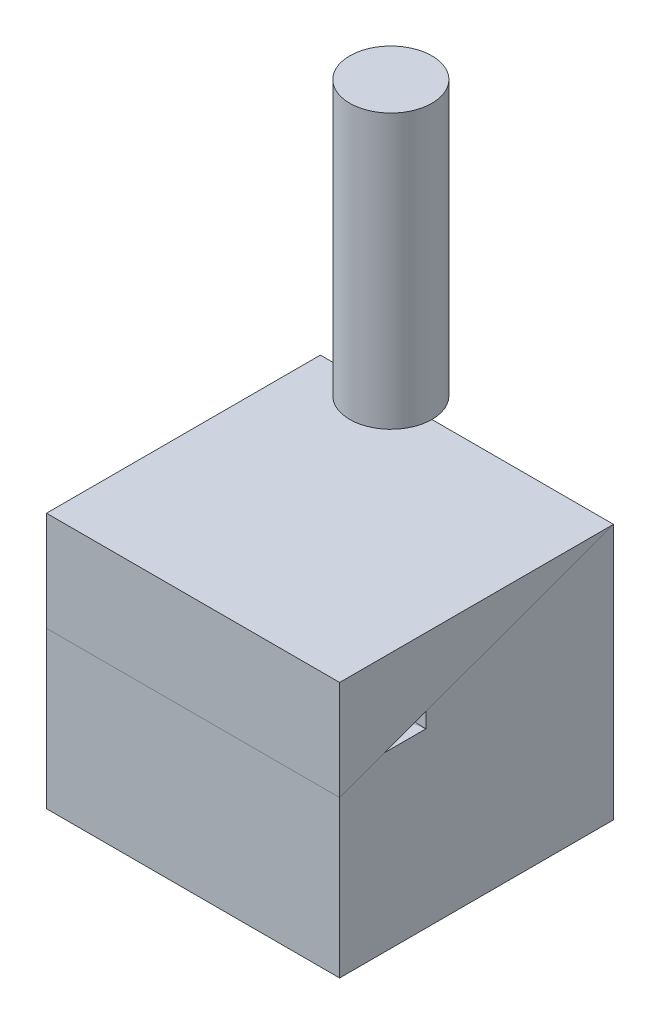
ISO-10303-21;
HEADER;
FILE_DESCRIPTION(('STEP AP214'),'2;1');
FILE_NAME('part.step','',(''),(''),'','','');
FILE_SCHEMA(('AUTOMOTIVE_DESIGN { 1 0 10303 214 1 1 1 1 }'));
ENDSEC;
DATA;
#1=APPLICATION_CONTEXT('core data for automotive mechanical design processes');
#2=APPLICATION_PROTOCOL_DEFINITION('international standard','automotive_design',2000,#1);
#3=PRODUCT_CONTEXT('',#1,'mechanical');
#4=PRODUCT('Part','Part','',(#3));
#5=PRODUCT_RELATED_PRODUCT_CATEGORY('part','',(#4));
#6=PRODUCT_DEFINITION_FORMATION('','',#4);
#7=PRODUCT_DEFINITION_CONTEXT('part definition',#1,'design');
#8=PRODUCT_DEFINITION('design','',#6,#7);
#9=PRODUCT_DEFINITION_SHAPE('','',#8);
#10=(LENGTH_UNIT() NAMED_UNIT(*) SI_UNIT(.MILLI.,.METRE.));
#11=(NAMED_UNIT(*) PLANE_ANGLE_UNIT() SI_UNIT($,.RADIAN.));
#12=(NAMED_UNIT(*) SI_UNIT($,.STERADIAN.) SOLID_ANGLE_UNIT());
#13=UNCERTAINTY_MEASURE_WITH_UNIT(LENGTH_MEASURE(1.E-05),#10,'distance_accuracy_value','');
#14=(GEOMETRIC_REPRESENTATION_CONTEXT(3) GLOBAL_UNCERTAINTY_ASSIGNED_CONTEXT((#13)) GLOBAL_UNIT_ASSIGNED_CONTEXT((#10,
#11,#12)) REPRESENTATION_CONTEXT('',''));
#15=CARTESIAN_POINT('',(0.,0.,0.));
#16=DIRECTION('',(0.,0.,1.));
#17=DIRECTION('',(1.,0.,0.));
#18=AXIS2_PLACEMENT_3D('',#15,#16,#17);
#19=CARTESIAN_POINT('',(25.7387296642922,193.461267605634,0.));
#20=DIRECTION('',(0.,-1.,0.));
#21=DIRECTION('',(0.,0.,-1.));
#22=AXIS2_PLACEMENT_3D('',#19,#20,#21);
#23=CYLINDRICAL_SURFACE('',#22,15.);
#24=CARTESIAN_POINT('',(25.7387296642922,193.461267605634,0.));
#25=DIRECTION('',(0.,1.,0.));
#26=DIRECTION('',(0.,0.,1.));
#27=AXIS2_PLACEMENT_3D('',#24,#25,#26);
#28=CIRCLE('',#27,15.);
#29=CARTESIAN_POINT('',(25.7387296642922,193.461267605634,15.));
#30=VERTEX_POINT('',#29);
#31=EDGE_CURVE('E387',#30,#30,#28,.T.);
#32=ORIENTED_EDGE('',*,*,#31,.F.);
#33=EDGE_LOOP('',(#32));
#34=FACE_BOUND('',#33,.T.);
#35=CARTESIAN_POINT('',(25.7387296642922,93.4612676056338,0.));
#36=DIRECTION('',(0.,1.,0.));
#37=DIRECTION('',(0.,0.,1.));
#38=AXIS2_PLACEMENT_3D('',#35,#36,#37);
#39=CIRCLE('',#38,15.);
#40=CARTESIAN_POINT('',(25.7387296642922,93.4612676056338,15.));
#41=VERTEX_POINT('',#40);
#42=EDGE_CURVE('E465',#41,#41,#39,.T.);
#43=ORIENTED_EDGE('',*,*,#42,.T.);
#44=EDGE_LOOP('',(#43));
#45=FACE_BOUND('',#44,.T.);
#46=ADVANCED_FACE('F459',(#34,#45),#23,.T.);
#47=CARTESIAN_POINT('',(25.7387296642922,193.461267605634,0.));
#48=DIRECTION('',(0.,1.,0.));
#49=DIRECTION('',(0.,0.,1.));
#50=AXIS2_PLACEMENT_3D('',#47,#48,#49);
#51=PLANE('',#50);
#52=ORIENTED_EDGE('',*,*,#31,.T.);
#53=EDGE_LOOP('',(#52));
#54=FACE_BOUND('',#53,.T.);
#55=ADVANCED_FACE('F474',(#54),#51,.T.);
#56=CARTESIAN_POINT('',(25.7387296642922,93.4612676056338,0.));
#57=DIRECTION('',(0.,1.,0.));
#58=DIRECTION('',(0.,0.,1.));
#59=AXIS2_PLACEMENT_3D('',#56,#57,#58);
#60=PLANE('',#59);
#61=ORIENTED_EDGE('',*,*,#42,.F.);
#62=EDGE_LOOP('',(#61));
#63=FACE_BOUND('',#62,.T.);
#64=ADVANCED_FACE('F472',(#63),#60,.F.);
#65=CLOSED_SHELL('',(#46,#55,#64));
#66=MANIFOLD_SOLID_BREP('B82_NOT_SHOWN',#65);
#67=CARTESIAN_POINT('',(0.,82.5283761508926,30.0378724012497));
#68=DIRECTION('',(0.,0.939692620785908,0.34202014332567));
#69=DIRECTION('',(0.,-0.34202014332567,0.939692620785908));
#70=AXIS2_PLACEMENT_3D('',#67,#68,#69);
#71=PLANE('',#70);
#72=CARTESIAN_POINT('',(10.7387296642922,93.4612676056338,0.));
#73=CARTESIAN_POINT('',(10.7289323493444,93.3621682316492,0.272273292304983));
#74=CARTESIAN_POINT('',(10.7193417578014,93.263066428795,0.544553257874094));
#75=CARTESIAN_POINT('',(10.6912051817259,92.9657536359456,1.36141344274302));
#76=CARTESIAN_POINT('',(10.6732944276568,92.7675355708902,1.90601310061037));
#77=CARTESIAN_POINT('',(10.6392470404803,92.3710801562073,2.9952654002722));
#78=CARTESIAN_POINT('',(10.6231104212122,92.1728428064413,3.53991804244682));
#79=CARTESIAN_POINT('',(10.5774848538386,91.5780512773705,5.1740943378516));
#80=CARTESIAN_POINT('',(10.5507853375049,91.1814714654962,6.26368841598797));
#81=CARTESIAN_POINT('',(10.5055814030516,90.3882560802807,8.44302977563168));
#82=CARTESIAN_POINT('',(10.4870770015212,89.9916205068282,9.53277705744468));
#83=CARTESIAN_POINT('',(10.4591356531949,89.1983114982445,11.7123756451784));
#84=CARTESIAN_POINT('',(10.4496986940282,88.8016380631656,12.8022269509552));
#85=CARTESIAN_POINT('',(10.4409014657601,88.0082760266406,14.9819712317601));
#86=CARTESIAN_POINT('',(10.441541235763,87.6115874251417,16.0718642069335));
#87=CARTESIAN_POINT('',(10.4557063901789,86.7139723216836,18.538041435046));
#88=CARTESIAN_POINT('',(10.4725741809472,86.2130510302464,19.9143113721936));
#89=CARTESIAN_POINT('',(10.5270424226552,85.2113219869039,22.6665392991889));
#90=CARTESIAN_POINT('',(10.5646434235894,84.7105142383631,24.0424972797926));
#91=CARTESIAN_POINT('',(10.6640603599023,83.7091186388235,26.7938090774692));
#92=CARTESIAN_POINT('',(10.7258789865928,83.2085308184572,28.1691628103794));
#93=CARTESIAN_POINT('',(10.8781521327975,82.2071912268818,30.9203207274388));
#94=CARTESIAN_POINT('',(10.9686439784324,81.7064400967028,32.2961231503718));
#95=CARTESIAN_POINT('',(11.1299935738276,80.9559776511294,34.3580017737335));
#96=CARTESIAN_POINT('',(11.1880434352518,80.7059411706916,35.0449713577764));
#97=CARTESIAN_POINT('',(11.3135278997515,80.2061450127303,36.4181500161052));
#98=CARTESIAN_POINT('',(11.3809623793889,79.9563853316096,37.1043591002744));
#99=CARTESIAN_POINT('',(11.5261427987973,79.4572485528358,38.4757261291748));
#100=CARTESIAN_POINT('',(11.6038873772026,79.2078714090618,39.1608842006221));
#101=CARTESIAN_POINT('',(11.7707665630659,78.7095662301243,40.5299664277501));
#102=CARTESIAN_POINT('',(11.8599009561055,78.4606381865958,41.2138906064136));
#103=CARTESIAN_POINT('',(12.0586659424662,77.9428079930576,42.6366173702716));
#104=CARTESIAN_POINT('',(12.1693813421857,77.6739542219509,43.3752870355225));
#105=CARTESIAN_POINT('',(12.4073840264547,77.1370936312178,44.8502993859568));
#106=CARTESIAN_POINT('',(12.5346717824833,76.8690868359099,45.5866420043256));
#107=CARTESIAN_POINT('',(12.8079079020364,76.3341458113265,47.0563803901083));
#108=CARTESIAN_POINT('',(12.953858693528,76.067211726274,47.789775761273));
#109=CARTESIAN_POINT('',(13.2668822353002,75.5346634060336,49.2529402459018));
#110=CARTESIAN_POINT('',(13.4339643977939,75.2690498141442,49.9827075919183));
#111=CARTESIAN_POINT('',(13.7917077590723,74.7401078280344,51.4359637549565));
#112=CARTESIAN_POINT('',(13.9823320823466,74.4767765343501,52.1594605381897));
#113=CARTESIAN_POINT('',(14.3905414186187,73.95256466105,53.5997208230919));
#114=CARTESIAN_POINT('',(14.6081254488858,73.691683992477,54.3164845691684));
#115=CARTESIAN_POINT('',(15.0737505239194,73.1732530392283,55.7408619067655));
#116=CARTESIAN_POINT('',(15.3217751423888,72.9157010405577,56.4484802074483));
#117=CARTESIAN_POINT('',(15.8522829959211,72.40486440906,57.8519923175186));
#118=CARTESIAN_POINT('',(16.1347535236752,72.1515782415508,58.5478903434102));
#119=CARTESIAN_POINT('',(16.78099566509,71.6151669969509,60.0216681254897));
#120=CARTESIAN_POINT('',(17.1506144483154,71.3328584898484,60.797304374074));
#121=CARTESIAN_POINT('',(17.946790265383,70.7776992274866,62.3225919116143));
#122=CARTESIAN_POINT('',(18.3733424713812,70.5048476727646,63.0722453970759));
#123=CARTESIAN_POINT('',(19.0588410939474,70.1055256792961,64.1693735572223));
#124=CARTESIAN_POINT('',(19.2944355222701,69.9743302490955,64.529830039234));
#125=CARTESIAN_POINT('',(19.781517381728,69.7154443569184,65.241113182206));
#126=CARTESIAN_POINT('',(20.0330030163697,69.5877535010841,65.5919409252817));
#127=CARTESIAN_POINT('',(20.5522053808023,69.3362730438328,66.2828778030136));
#128=CARTESIAN_POINT('',(20.8199234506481,69.212483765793,66.6229860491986));
#129=CARTESIAN_POINT('',(21.3716169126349,68.969236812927,67.291301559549));
#130=CARTESIAN_POINT('',(21.6555903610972,68.8497786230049,67.6195102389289));
#131=CARTESIAN_POINT('',(22.2421561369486,68.6145486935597,68.2657991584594));
#132=CARTESIAN_POINT('',(22.5448876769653,68.4988175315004,68.5837679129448));
#133=CARTESIAN_POINT('',(23.1663090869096,68.2724501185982,69.205707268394));
#134=CARTESIAN_POINT('',(23.4850010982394,68.1618145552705,69.5096759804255));
#135=CARTESIAN_POINT('',(24.137553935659,67.9459157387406,70.1028531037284));
#136=CARTESIAN_POINT('',(24.4714142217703,67.840652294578,70.3920620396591));
#137=CARTESIAN_POINT('',(25.1532453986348,67.6356806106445,70.955217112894));
#138=CARTESIAN_POINT('',(25.501212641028,67.5359709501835,71.2291671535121));
#139=CARTESIAN_POINT('',(26.2113095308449,67.341819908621,71.7625927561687));
#140=CARTESIAN_POINT('',(26.5734810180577,67.2473964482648,72.0220190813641));
#141=CARTESIAN_POINT('',(27.3096497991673,67.0641040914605,72.5256106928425));
#142=CARTESIAN_POINT('',(27.6836475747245,66.9752354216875,72.7697753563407));
#143=CARTESIAN_POINT('',(28.4421998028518,66.8028759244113,73.2433291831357));
#144=CARTESIAN_POINT('',(28.8267567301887,66.7193863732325,73.4727148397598));
#145=CARTESIAN_POINT('',(29.6050372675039,66.5575513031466,73.9173530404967));
#146=CARTESIAN_POINT('',(29.9987617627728,66.4792062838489,74.1326042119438));
#147=CARTESIAN_POINT('',(30.8933874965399,66.3083908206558,74.6019158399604));
#148=CARTESIAN_POINT('',(31.3965056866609,66.2172770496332,74.8522488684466));
#149=CARTESIAN_POINT('',(32.1586903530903,66.0857134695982,75.2137168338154));
#150=CARTESIAN_POINT('',(32.4140272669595,66.0427063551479,75.3318779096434));
#151=CARTESIAN_POINT('',(32.9269939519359,65.958322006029,75.563722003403));
#152=CARTESIAN_POINT('',(33.1846237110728,65.9169447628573,75.6774050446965));
#153=CARTESIAN_POINT('',(33.9608859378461,65.7951562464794,76.0120162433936));
#154=CARTESIAN_POINT('',(34.4827154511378,65.7171184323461,76.2264233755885));
#155=CARTESIAN_POINT('',(35.5337140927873,65.5669404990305,76.6390338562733));
#156=CARTESIAN_POINT('',(36.0628851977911,65.4948020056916,76.8372327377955));
#157=CARTESIAN_POINT('',(37.1273053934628,65.3560465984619,77.2184600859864));
#158=CARTESIAN_POINT('',(37.6625538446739,65.2894291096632,77.4014901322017));
#159=CARTESIAN_POINT('',(38.7432304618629,65.1607256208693,77.7551000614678));
#160=CARTESIAN_POINT('',(39.2887069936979,65.098687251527,77.9255490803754));
#161=CARTESIAN_POINT('',(40.383932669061,64.9794740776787,78.2530845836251));
#162=CARTESIAN_POINT('',(40.9336800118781,64.9222973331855,78.4101763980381));
#163=CARTESIAN_POINT('',(42.0368686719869,64.8124341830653,78.7120229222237));
#164=CARTESIAN_POINT('',(42.5903092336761,64.759746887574,78.8567800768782));
#165=CARTESIAN_POINT('',(43.7003361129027,64.6585234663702,79.1348891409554));
#166=CARTESIAN_POINT('',(44.2569219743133,64.609986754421,79.2682426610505));
#167=CARTESIAN_POINT('',(45.3727074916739,64.5167582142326,79.5243859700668));
#168=CARTESIAN_POINT('',(45.9319065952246,64.4720656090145,79.6471778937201));
#169=CARTESIAN_POINT('',(47.7685098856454,64.33138250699,80.0337015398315));
#170=CARTESIAN_POINT('',(49.0507992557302,64.2427980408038,80.2770853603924));
#171=CARTESIAN_POINT('',(51.623646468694,64.0809751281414,80.7216901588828));
#172=CARTESIAN_POINT('',(52.9142054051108,64.0077387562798,80.9229054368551));
#173=CARTESIAN_POINT('',(55.5020392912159,63.874050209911,81.2902116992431));
#174=CARTESIAN_POINT('',(56.7993190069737,63.8136089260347,81.4562727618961));
#175=CARTESIAN_POINT('',(59.3990926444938,63.7033950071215,81.7590830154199));
#176=CARTESIAN_POINT('',(60.7015906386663,63.6536337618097,81.8958009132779));
#177=CARTESIAN_POINT('',(63.3104372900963,63.5629887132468,82.1448461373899));
#178=CARTESIAN_POINT('',(64.6167884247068,63.5221133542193,82.2571502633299));
#179=CARTESIAN_POINT('',(67.2320549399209,63.4476902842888,82.4616259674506));
#180=CARTESIAN_POINT('',(68.5409714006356,63.4141470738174,82.5537851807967));
#181=CARTESIAN_POINT('',(71.0857656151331,63.3547579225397,82.7169555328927));
#182=CARTESIAN_POINT('',(72.3215788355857,63.3285834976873,82.788869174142));
#183=CARTESIAN_POINT('',(74.7933897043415,63.2805061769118,82.9209605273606));
#184=CARTESIAN_POINT('',(76.0293870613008,63.2586015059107,82.9811431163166));
#185=CARTESIAN_POINT('',(78.5004751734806,63.2181175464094,83.0923718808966));
#186=CARTESIAN_POINT('',(79.7355654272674,63.1995346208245,83.1434280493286));
#187=CARTESIAN_POINT('',(82.203757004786,63.1648139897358,83.2388221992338));
#188=CARTESIAN_POINT('',(83.4368578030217,63.148671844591,83.2831723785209));
#189=CARTESIAN_POINT('',(85.8999925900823,63.1180018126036,83.3674375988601));
#190=CARTESIAN_POINT('',(87.1300261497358,63.103469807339,83.4073639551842));
#191=CARTESIAN_POINT('',(89.5859569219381,63.0752311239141,83.484949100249));
#192=CARTESIAN_POINT('',(90.8118538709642,63.061521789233,83.5226151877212));
#193=CARTESIAN_POINT('',(92.0377464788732,63.0478078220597,83.5602940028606));
#194=B_SPLINE_CURVE_WITH_KNOTS('',3,(#72,#73,#74,#75,#76,#77,#78,#79,#80,#81,#82,#83,#84,#85,
#86,#87,#88,#89,#90,#91,#92,#93,#94,#95,#96,#97,#98,#99,#100,#101,#102,#103,#104,#105,#106,#107,
#108,#109,#110,#111,#112,#113,#114,#115,#116,#117,#118,#119,#120,#121,#122,#123,#124,#125,#126,
#127,#128,#129,#130,#131,#132,#133,#134,#135,#136,#137,#138,#139,#140,#141,#142,#143,#144,#145,
#146,#147,#148,#149,#150,#151,#152,#153,#154,#155,#156,#157,#158,#159,#160,#161,#162,#163,#164,
#165,#166,#167,#168,#169,#170,#171,#172,#173,#174,#175,#176,#177,#178,#179,#180,#181,#182,#183,
#184,#185,#186,#187,#188,#189,#190,#191,#192,#193),.UNSPECIFIED.,.F.,.F.,(4,2,2,2,2,2,2,2,2,2,2,
2,2,2,2,2,2,2,2,2,2,2,2,2,2,2,2,2,2,2,2,2,2,2,2,2,2,2,2,2,2,2,2,2,2,2,2,2,2,2,2,2,2,2,2,2,2,2,2,
2,4),(0.,0.869738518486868,2.6092182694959,4.34871158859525,7.82817078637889,11.3076370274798,
14.7870985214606,18.2665735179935,22.6605243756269,27.0545917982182,31.4491476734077,
35.849447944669,38.049475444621,40.2494740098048,42.4491823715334,44.6488493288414,
47.0301946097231,49.4116076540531,51.7933308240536,54.1761186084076,56.555220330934,
58.9342353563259,61.3119722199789,63.6888345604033,66.4001631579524,69.111261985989,
70.4614179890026,71.8114216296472,73.1615368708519,74.5114910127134,75.8730638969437,
77.2348199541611,78.5965275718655,79.9578852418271,81.3236087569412,82.6893879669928,
84.0554900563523,85.4217246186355,87.1290517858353,87.9828744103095,88.8366925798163,
90.5449192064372,92.2536150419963,93.9621327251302,95.6864584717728,97.4100928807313,
99.1333848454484,100.856433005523,102.579132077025,106.502592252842,110.426582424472,
114.353899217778,118.285383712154,122.220588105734,126.158201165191,129.872666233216,
133.585583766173,137.294410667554,140.996408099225,144.688706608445,148.368357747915),.UNSPECIFIED.);
#195=CARTESIAN_POINT('',(10.4424672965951,87.89796101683,15.2850592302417));
#196=VERTEX_POINT('',#195);
#197=CARTESIAN_POINT('',(92.0377246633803,63.0478078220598,83.560294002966));
#198=VERTEX_POINT('',#197);
#199=EDGE_CURVE('E526',#196,#198,#194,.T.);
#200=ORIENTED_EDGE('',*,*,#199,.F.);
#201=CARTESIAN_POINT('',(10.4424672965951,87.8979608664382,15.2850596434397));
#202=CARTESIAN_POINT('',(10.4424698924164,88.1298267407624,14.6480133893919));
#203=CARTESIAN_POINT('',(10.4441955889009,88.3616922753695,14.0109680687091));
#204=CARTESIAN_POINT('',(10.4509090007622,88.8254050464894,12.7369277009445));
#205=CARTESIAN_POINT('',(10.4558965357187,89.0572522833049,12.0999326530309));
#206=CARTESIAN_POINT('',(10.4689492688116,89.5209288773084,10.8259916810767));
#207=CARTESIAN_POINT('',(10.4770143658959,89.7527582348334,10.1890457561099));
#208=CARTESIAN_POINT('',(10.4960551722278,90.2163996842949,8.91520134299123));
#209=CARTESIAN_POINT('',(10.5070308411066,90.4482117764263,8.27830285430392));
#210=CARTESIAN_POINT('',(10.5317367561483,90.9118171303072,7.00455761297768));
#211=CARTESIAN_POINT('',(10.5454669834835,91.1436103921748,6.36771086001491));
#212=CARTESIAN_POINT('',(10.575537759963,91.6071815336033,5.09405961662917));
#213=CARTESIAN_POINT('',(10.5918783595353,91.8389594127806,4.45725512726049));
#214=CARTESIAN_POINT('',(10.6270350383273,92.3025009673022,3.18368517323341));
#215=CARTESIAN_POINT('',(10.6458512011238,92.5342646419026,2.54691971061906));
#216=CARTESIAN_POINT('',(10.6858357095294,92.9977789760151,1.27342454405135));
#217=CARTESIAN_POINT('',(10.7070041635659,93.2295296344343,0.636694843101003));
#218=CARTESIAN_POINT('',(10.7292864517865,93.4612676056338,0.));
#219=B_SPLINE_CURVE_WITH_KNOTS('',3,(#201,#202,#203,#204,#205,#206,#207,#208,#209,#210,#211,
#212,#213,#214,#215,#216,#217,#218),.UNSPECIFIED.,.F.,.F.,(4,2,2,2,2,2,2,2,4),(0.,
2.03378775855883,4.06746303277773,6.10107153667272,8.13465183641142,10.1682182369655,
12.2018239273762,14.235498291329,16.2692664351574),.UNSPECIFIED.);
#220=CARTESIAN_POINT('',(10.7292864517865,93.4612676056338,0.));
#221=VERTEX_POINT('',#220);
#222=EDGE_CURVE('E604',#196,#221,#219,.T.);
#223=ORIENTED_EDGE('',*,*,#222,.T.);
#224=DIRECTION('',(-1.,0.,0.));
#225=VECTOR('',#224,1.);
#226=CARTESIAN_POINT('',(0.,93.4612676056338,0.));
#227=LINE('',#226,#225);
#228=CARTESIAN_POINT('',(0.,93.4612676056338,0.));
#229=VERTEX_POINT('',#228);
#230=EDGE_CURVE('E588',#221,#229,#227,.T.);
#231=ORIENTED_EDGE('',*,*,#230,.T.);
#232=DIRECTION('',(0.,-0.34202014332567,0.939692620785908));
#233=VECTOR('',#232,1.);
#234=CARTESIAN_POINT('',(0.,50.3889956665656,118.340094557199));
#235=LINE('',#234,#233);
#236=CARTESIAN_POINT('',(0.,57.0642441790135,100.));
#237=VERTEX_POINT('',#236);
#238=EDGE_CURVE('E756',#229,#237,#235,.T.);
#239=ORIENTED_EDGE('',*,*,#238,.T.);
#240=DIRECTION('',(1.,0.,0.));
#241=VECTOR('',#240,1.);
#242=CARTESIAN_POINT('',(0.,57.0642441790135,100.));
#243=LINE('',#242,#241);
#244=CARTESIAN_POINT('',(107.037746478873,57.0642441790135,100.));
#245=VERTEX_POINT('',#244);
#246=EDGE_CURVE('E755',#237,#245,#243,.T.);
#247=ORIENTED_EDGE('',*,*,#246,.T.);
#248=DIRECTION('',(0.,0.34202014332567,-0.939692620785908));
#249=VECTOR('',#248,1.);
#250=CARTESIAN_POINT('',(107.037746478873,50.3889956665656,118.340094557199));
#251=LINE('',#250,#249);
#252=CARTESIAN_POINT('',(107.037746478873,63.0478078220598,83.5602940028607));
#253=VERTEX_POINT('',#252);
#254=EDGE_CURVE('E751',#245,#253,#251,.T.);
#255=ORIENTED_EDGE('',*,*,#254,.T.);
#256=DIRECTION('',(-1.,0.,0.));
#257=VECTOR('',#256,1.);
#258=CARTESIAN_POINT('',(0.,63.0478078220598,83.5602940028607));
#259=LINE('',#258,#257);
#260=EDGE_CURVE('E531',#253,#198,#259,.T.);
#261=ORIENTED_EDGE('',*,*,#260,.T.);
#262=EDGE_LOOP('',(#200,#223,#231,#239,#247,#255,#261));
#263=FACE_BOUND('',#262,.T.);
#264=ADVANCED_FACE('F510',(#263),#71,.T.);
#265=CARTESIAN_POINT('',(107.037746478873,0.,100.));
#266=DIRECTION('',(-1.,0.,0.));
#267=DIRECTION('',(0.,0.,1.));
#268=AXIS2_PLACEMENT_3D('',#265,#266,#267);
#269=PLANE('',#268);
#270=DIRECTION('',(0.,0.,-1.));
#271=VECTOR('',#270,1.);
#272=CARTESIAN_POINT('',(107.037746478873,63.0478078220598,100.));
#273=LINE('',#272,#271);
#274=CARTESIAN_POINT('',(107.037746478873,63.0478078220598,68.5602940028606));
#275=VERTEX_POINT('',#274);
#276=EDGE_CURVE('E457',#253,#275,#273,.T.);
#277=ORIENTED_EDGE('',*,*,#276,.F.);
#278=ORIENTED_EDGE('',*,*,#254,.F.);
#279=DIRECTION('',(0.,1.,0.));
#280=VECTOR('',#279,1.);
#281=CARTESIAN_POINT('',(107.037746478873,0.,100.));
#282=LINE('',#281,#280);
#283=CARTESIAN_POINT('',(107.037746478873,0.,100.));
#284=VERTEX_POINT('',#283);
#285=EDGE_CURVE('E765',#284,#245,#282,.T.);
#286=ORIENTED_EDGE('',*,*,#285,.F.);
#287=DIRECTION('',(0.,0.,-1.));
#288=VECTOR('',#287,1.);
#289=CARTESIAN_POINT('',(107.037746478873,0.,100.));
#290=LINE('',#289,#288);
#291=CARTESIAN_POINT('',(107.037746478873,0.,0.));
#292=VERTEX_POINT('',#291);
#293=EDGE_CURVE('E768',#284,#292,#290,.T.);
#294=ORIENTED_EDGE('',*,*,#293,.T.);
#295=DIRECTION('',(0.,1.,0.));
#296=VECTOR('',#295,1.);
#297=CARTESIAN_POINT('',(107.037746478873,0.,0.));
#298=LINE('',#297,#296);
#299=CARTESIAN_POINT('',(107.037746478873,93.4612676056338,0.));
#300=VERTEX_POINT('',#299);
#301=EDGE_CURVE('E771',#292,#300,#298,.T.);
#302=ORIENTED_EDGE('',*,*,#301,.T.);
#303=CARTESIAN_POINT('',(107.037746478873,68.5099392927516,68.5532111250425));
#304=VERTEX_POINT('',#303);
#305=EDGE_CURVE('E757',#304,#300,#251,.T.);
#306=ORIENTED_EDGE('',*,*,#305,.F.);
#307=DIRECTION('',(0.,1.,0.));
#308=VECTOR('',#307,1.);
#309=CARTESIAN_POINT('',(107.037746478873,123.6290767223,68.5532111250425));
#310=LINE('',#309,#308);
#311=CARTESIAN_POINT('',(107.037746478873,63.0529640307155,68.5532111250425));
#312=VERTEX_POINT('',#311);
#313=EDGE_CURVE('E519',#304,#312,#310,.F.);
#314=ORIENTED_EDGE('',*,*,#313,.T.);
#315=CARTESIAN_POINT('',(107.037746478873,63.2414614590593,84.1042314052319));
#316=CARTESIAN_POINT('',(107.037744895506,-1497.20870907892,889.556205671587));
#317=CARTESIAN_POINT('',(107.037746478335,64.6985666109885,73.5336250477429));
#318=CARTESIAN_POINT('',(107.037746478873,63.0576720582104,68.5589304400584));
#319=CARTESIAN_POINT('',(107.037746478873,63.0570986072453,68.5576167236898));
#320=CARTESIAN_POINT('',(107.037746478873,63.0561227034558,68.5558546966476));
#321=CARTESIAN_POINT('',(107.037746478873,63.0558200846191,68.5553545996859));
#322=CARTESIAN_POINT('',(107.037746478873,63.0551150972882,68.5544062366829));
#323=CARTESIAN_POINT('',(107.037746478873,63.054711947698,68.5539584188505));
#324=CARTESIAN_POINT('',(107.037746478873,63.0540154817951,68.5534952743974));
#325=CARTESIAN_POINT('',(107.037746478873,63.0537956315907,68.5533801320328));
#326=CARTESIAN_POINT('',(107.037746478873,63.0533242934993,68.5532313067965));
#327=CARTESIAN_POINT('',(107.037746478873,63.0530725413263,68.5531983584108));
#328=CARTESIAN_POINT('',(107.037746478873,63.0526060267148,68.5532321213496));
#329=CARTESIAN_POINT('',(107.037746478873,63.0523903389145,68.5532878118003));
#330=CARTESIAN_POINT('',(107.037746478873,63.0518887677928,68.5534953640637));
#331=CARTESIAN_POINT('',(107.037746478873,63.0516180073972,68.5536802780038));
#332=CARTESIAN_POINT('',(107.037746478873,63.0508879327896,68.5542917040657));
#333=CARTESIAN_POINT('',(107.037746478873,63.050491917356,68.5547814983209));
#334=CARTESIAN_POINT('',(107.037746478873,63.0491542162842,68.5568910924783));
#335=CARTESIAN_POINT('',(107.037746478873,63.0486303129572,68.5588706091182));
#336=CARTESIAN_POINT('',(107.037746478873,63.0478078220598,68.5602940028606));
#337=B_SPLINE_CURVE_WITH_KNOTS('',3,(#315,#316,#317,#318,#319,#320,#321,#322,#323,#324,#325,
#326,#327,#328,#329,#330,#331,#332,#333,#334,#335,#336),.UNSPECIFIED.,.F.,.F.,(4,2,2,2,2,2,2,2,
2,2,4),(0.,15.5450063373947,15.5493065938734,15.5510603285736,15.5528281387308,15.5535629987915,
15.5543044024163,15.5549605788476,15.5559274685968,15.5578071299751,15.5633065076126),.UNSPECIFIED.);
#338=EDGE_CURVE('E705',#312,#275,#337,.T.);
#339=ORIENTED_EDGE('',*,*,#338,.T.);
#340=EDGE_LOOP('',(#277,#278,#286,#294,#302,#306,#314,#339));
#341=FACE_BOUND('',#340,.T.);
#342=ADVANCED_FACE('F659',(#341),#269,.F.);
#343=CARTESIAN_POINT('',(0.,93.4612676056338,0.));
#344=DIRECTION('',(0.,0.,-1.));
#345=DIRECTION('',(-1.,0.,0.));
#346=AXIS2_PLACEMENT_3D('',#343,#344,#345);
#347=PLANE('',#346);
#348=ORIENTED_EDGE('',*,*,#230,.F.);
#349=DIRECTION('',(0.,1.,0.));
#350=VECTOR('',#349,1.);
#351=CARTESIAN_POINT('',(10.7292864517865,153.846417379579,0.));
#352=LINE('',#351,#350);
#353=CARTESIAN_POINT('',(10.7292864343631,93.2703029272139,4.97860790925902E-07));
#354=VERTEX_POINT('',#353);
#355=EDGE_CURVE('E581',#221,#354,#352,.F.);
#356=ORIENTED_EDGE('',*,*,#355,.T.);
#357=CARTESIAN_POINT('',(40.7387296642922,93.4612676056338,-1.01047642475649E-13));
#358=CARTESIAN_POINT('',(40.732674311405,93.3998128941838,0.));
#359=CARTESIAN_POINT('',(40.7238375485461,93.3386597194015,0.));
#360=CARTESIAN_POINT('',(40.7009659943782,93.2174159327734,0.));
#361=CARTESIAN_POINT('',(40.6869383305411,93.1573239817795,0.));
#362=CARTESIAN_POINT('',(40.6542127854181,93.0391473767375,0.));
#363=CARTESIAN_POINT('',(40.6355681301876,92.9810478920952,0.));
#364=CARTESIAN_POINT('',(40.5939594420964,92.8664108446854,0.));
#365=CARTESIAN_POINT('',(40.5709934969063,92.8098739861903,-1.03974021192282E-13));
#366=CARTESIAN_POINT('',(40.4750361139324,92.595464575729,-2.50695808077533E-13));
#367=CARTESIAN_POINT('',(40.3881105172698,92.4436555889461,0.));
#368=CARTESIAN_POINT('',(40.2410542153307,92.2273541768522,0.));
#369=CARTESIAN_POINT('',(40.189053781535,92.156937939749,0.));
#370=CARTESIAN_POINT('',(40.0803820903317,92.0197958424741,0.));
#371=CARTESIAN_POINT('',(40.023711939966,91.9530691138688,0.));
#372=CARTESIAN_POINT('',(39.8601012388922,91.7716846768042,0.));
#373=CARTESIAN_POINT('',(39.7488772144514,91.6608968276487,0.));
#374=CARTESIAN_POINT('',(39.5173612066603,91.4492119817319,0.));
#375=CARTESIAN_POINT('',(39.3970616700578,91.3483233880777,0.));
#376=CARTESIAN_POINT('',(39.1495537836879,91.1550939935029,0.));
#377=CARTESIAN_POINT('',(39.0223357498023,91.0627656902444,0.));
#378=CARTESIAN_POINT('',(38.7627896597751,90.8857451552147,0.));
#379=CARTESIAN_POINT('',(38.63046318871,90.8010505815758,0.));
#380=CARTESIAN_POINT('',(38.3727862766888,90.6450038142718,0.));
#381=CARTESIAN_POINT('',(38.2477516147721,90.5731269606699,0.));
#382=CARTESIAN_POINT('',(37.9949104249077,90.4344102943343,0.));
#383=CARTESIAN_POINT('',(37.8671035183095,90.3675711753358,0.));
#384=CARTESIAN_POINT('',(37.4799323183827,90.1736735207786,0.));
#385=CARTESIAN_POINT('',(37.217144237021,90.0534280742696,0.));
#386=CARTESIAN_POINT('',(36.6850765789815,89.8279654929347,0.));
#387=CARTESIAN_POINT('',(36.4157924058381,89.7227593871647,0.));
#388=CARTESIAN_POINT('',(35.8716923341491,89.5249420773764,0.));
#389=CARTESIAN_POINT('',(35.5968615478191,89.4323720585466,0.));
#390=CARTESIAN_POINT('',(35.0439235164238,89.258648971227,0.));
#391=CARTESIAN_POINT('',(34.7658195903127,89.1774852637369,0.));
#392=CARTESIAN_POINT('',(34.2069416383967,89.0252428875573,0.));
#393=CARTESIAN_POINT('',(33.9261681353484,88.954162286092,0.));
#394=CARTESIAN_POINT('',(33.1969968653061,88.7820168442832,0.));
#395=CARTESIAN_POINT('',(32.746965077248,88.6878485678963,0.));
#396=CARTESIAN_POINT('',(31.8431324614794,88.5195614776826,0.));
#397=CARTESIAN_POINT('',(31.3893308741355,88.4454468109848,0.));
#398=CARTESIAN_POINT('',(30.4795707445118,88.3154381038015,0.));
#399=CARTESIAN_POINT('',(30.0236146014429,88.2595271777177,0.));
#400=CARTESIAN_POINT('',(29.1099981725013,88.1645304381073,0.));
#401=CARTESIAN_POINT('',(28.6523379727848,88.1254437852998,0.));
#402=CARTESIAN_POINT('',(27.576923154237,88.0524264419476,0.));
#403=CARTESIAN_POINT('',(26.9587206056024,88.0249909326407,0.));
#404=CARTESIAN_POINT('',(25.721480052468,87.9979996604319,0.));
#405=CARTESIAN_POINT('',(25.1024418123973,87.9984550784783,0.));
#406=CARTESIAN_POINT('',(23.8645871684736,88.0273163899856,0.));
#407=CARTESIAN_POINT('',(23.2457712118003,88.0557415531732,0.));
#408=CARTESIAN_POINT('',(22.0117049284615,88.1415744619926,0.));
#409=CARTESIAN_POINT('',(21.3964495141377,88.1989066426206,0.));
#410=CARTESIAN_POINT('',(20.4765767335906,88.3084799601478,0.));
#411=CARTESIAN_POINT('',(20.1705245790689,88.3489215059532,0.));
#412=CARTESIAN_POINT('',(19.559647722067,88.4381670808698,0.));
#413=CARTESIAN_POINT('',(19.2548229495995,88.4869706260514,0.));
#414=CARTESIAN_POINT('',(18.647036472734,88.5935204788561,0.));
#415=CARTESIAN_POINT('',(18.3440732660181,88.6512581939,0.));
#416=CARTESIAN_POINT('',(17.74019811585,88.7765373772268,0.));
#417=CARTESIAN_POINT('',(17.4392859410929,88.844077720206,0.));
#418=CARTESIAN_POINT('',(16.9420247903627,88.9652438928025,0.));
#419=CARTESIAN_POINT('',(16.7449228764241,89.0157888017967,0.));
#420=CARTESIAN_POINT('',(16.3521129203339,89.1220419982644,0.));
#421=CARTESIAN_POINT('',(16.1564048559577,89.1777502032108,0.));
#422=CARTESIAN_POINT('',(15.7663350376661,89.2949278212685,0.));
#423=CARTESIAN_POINT('',(15.5719762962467,89.3564073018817,0.));
#424=CARTESIAN_POINT('',(15.1853610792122,89.4856585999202,0.));
#425=CARTESIAN_POINT('',(14.9931045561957,89.5534302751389,0.));
#426=CARTESIAN_POINT('',(14.5834257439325,89.7064112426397,0.));
#427=CARTESIAN_POINT('',(14.3664113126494,89.7927230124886,0.));
#428=CARTESIAN_POINT('',(13.9368712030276,89.9761400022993,0.));
#429=CARTESIAN_POINT('',(13.7243472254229,90.0732492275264,0.));
#430=CARTESIAN_POINT('',(13.3062033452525,90.2799199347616,0.));
#431=CARTESIAN_POINT('',(13.1005629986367,90.389439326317,0.));
#432=CARTESIAN_POINT('',(12.7989166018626,90.5652280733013,0.));
#433=CARTESIAN_POINT('',(12.6995341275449,90.6257214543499,0.));
#434=CARTESIAN_POINT('',(12.5035193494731,90.7509963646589,0.));
#435=CARTESIAN_POINT('',(12.4068865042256,90.8157770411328,1.14878225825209E-13));
#436=CARTESIAN_POINT('',(12.239742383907,90.9340419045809,0.));
#437=CARTESIAN_POINT('',(12.1685182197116,90.9865154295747,0.));
#438=CARTESIAN_POINT('',(12.0284121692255,91.0944772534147,0.));
#439=CARTESIAN_POINT('',(11.959530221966,91.1499654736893,0.));
#440=CARTESIAN_POINT('',(11.7567631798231,91.321596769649,0.));
#441=CARTESIAN_POINT('',(11.6269617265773,91.442764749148,0.));
#442=CARTESIAN_POINT('',(11.4438319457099,91.6369158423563,0.));
#443=CARTESIAN_POINT('',(11.3843825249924,91.7041600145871,0.));
#444=CARTESIAN_POINT('',(11.2706405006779,91.8429381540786,0.));
#445=CARTESIAN_POINT('',(11.2163488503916,91.9144729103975,0.));
#446=CARTESIAN_POINT('',(11.1142802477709,92.0617814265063,0.));
#447=CARTESIAN_POINT('',(11.0664846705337,92.1375421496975,0.));
#448=CARTESIAN_POINT('',(10.9786709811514,92.2933851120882,0.));
#449=CARTESIAN_POINT('',(10.9386471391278,92.3734641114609,2.65499281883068E-13));
#450=CARTESIAN_POINT('',(10.8578954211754,92.5610035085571,-3.31665484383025E-13));
#451=CARTESIAN_POINT('',(10.8201624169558,92.6698086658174,-1.41733801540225E-12));
#452=CARTESIAN_POINT('',(10.7774920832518,92.8364066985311,7.08025562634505E-13));
#453=CARTESIAN_POINT('',(10.765592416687,92.892478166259,2.04066795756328E-12));
#454=CARTESIAN_POINT('',(10.7466820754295,93.0054353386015,-2.03989926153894E-12));
#455=CARTESIAN_POINT('',(10.7396695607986,93.0623207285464,-7.45056798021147E-12));
#456=CARTESIAN_POINT('',(10.7307402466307,93.1762710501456,7.42854230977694E-12));
#457=CARTESIAN_POINT('',(10.7288041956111,93.2333344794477,2.76207935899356E-11));
#458=CARTESIAN_POINT('',(10.7299777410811,93.3474375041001,-2.76344412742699E-11));
#459=CARTESIAN_POINT('',(10.7330898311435,93.4044770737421,-1.03129188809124E-10));
#460=CARTESIAN_POINT('',(10.7387296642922,93.4612676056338,-2.87153981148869E-10));
#461=B_SPLINE_CURVE_WITH_KNOTS('',3,(#357,#358,#359,#360,#361,#362,#363,#364,#365,#366,#367,
#368,#369,#370,#371,#372,#373,#374,#375,#376,#377,#378,#379,#380,#381,#382,#383,#384,#385,#386,
#387,#388,#389,#390,#391,#392,#393,#394,#395,#396,#397,#398,#399,#400,#401,#402,#403,#404,#405,
#406,#407,#408,#409,#410,#411,#412,#413,#414,#415,#416,#417,#418,#419,#420,#421,#422,#423,#424,
#425,#426,#427,#428,#429,#430,#431,#432,#433,#434,#435,#436,#437,#438,#439,#440,#441,#442,#443,
#444,#445,#446,#447,#448,#449,#450,#451,#452,#453,#454,#455,#456,#457,#458,#459,#460),
.UNSPECIFIED.,.F.,.F.,(4,2,2,2,2,2,2,2,2,2,2,2,2,2,2,2,2,2,2,2,2,2,2,2,2,2,2,2,2,2,2,2,2,2,2,2,
2,2,2,2,2,2,2,2,2,2,2,2,2,2,2,4),(0.,0.185153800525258,0.370054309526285,0.552915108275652,
0.735857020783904,1.25730456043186,1.51980337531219,1.7822401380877,2.25241736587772,
2.72299031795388,3.19423981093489,3.66534423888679,4.09788055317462,4.53047632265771,
5.39680399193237,6.26376375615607,7.13348499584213,8.00238955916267,8.87112734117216,
10.2498977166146,11.6289530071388,13.0067254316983,14.3844291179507,16.2401822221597,
18.0966792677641,19.9544562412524,21.807401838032,22.7334467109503,23.6594380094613,
24.5845441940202,25.5095442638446,26.1199232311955,26.7302924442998,27.3417469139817,
27.9531875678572,28.6535800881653,29.3542332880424,30.0525775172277,30.4015269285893,
30.7504071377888,31.0157246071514,31.2810351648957,31.8124012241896,32.0814737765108,
32.3505959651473,32.6189294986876,32.8870644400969,33.2309427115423,33.4027257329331,
33.5744440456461,33.7455102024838,33.9166608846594),.UNSPECIFIED.);
#462=CARTESIAN_POINT('',(40.7387296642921,93.4612676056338,0.));
#463=VERTEX_POINT('',#462);
#464=EDGE_CURVE('E585',#463,#354,#461,.T.);
#465=ORIENTED_EDGE('',*,*,#464,.F.);
#466=EDGE_CURVE('E764',#300,#463,#227,.T.);
#467=ORIENTED_EDGE('',*,*,#466,.F.);
#468=ORIENTED_EDGE('',*,*,#301,.F.);
#469=DIRECTION('',(1.,0.,0.));
#470=VECTOR('',#469,1.);
#471=CARTESIAN_POINT('',(0.,0.,0.));
#472=LINE('',#471,#470);
#473=CARTESIAN_POINT('',(0.,0.,0.));
#474=VERTEX_POINT('',#473);
#475=EDGE_CURVE('E787',#474,#292,#472,.T.);
#476=ORIENTED_EDGE('',*,*,#475,.F.);
#477=DIRECTION('',(0.,-1.,0.));
#478=VECTOR('',#477,1.);
#479=CARTESIAN_POINT('',(0.,0.,0.));
#480=LINE('',#479,#478);
#481=EDGE_CURVE('E600',#229,#474,#480,.T.);
#482=ORIENTED_EDGE('',*,*,#481,.F.);
#483=EDGE_LOOP('',(#348,#356,#465,#467,#468,#476,#482));
#484=FACE_BOUND('',#483,.T.);
#485=ADVANCED_FACE('F583',(#484),#347,.T.);
#486=CARTESIAN_POINT('',(107.037746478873,63.242100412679,83.0264794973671));
#487=CARTESIAN_POINT('',(106.20725781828,63.255847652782,82.9887092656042));
#488=CARTESIAN_POINT('',(105.376869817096,63.2703483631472,82.9488688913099));
#489=CARTESIAN_POINT('',(103.716296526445,63.3011591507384,82.8642169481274));
#490=CARTESIAN_POINT('',(102.886111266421,63.3174694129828,82.8194048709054));
#491=CARTESIAN_POINT('',(101.226088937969,63.3521995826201,82.7239845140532));
#492=CARTESIAN_POINT('',(100.39625188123,63.3706195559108,82.6733760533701));
#493=CARTESIAN_POINT('',(98.7378794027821,63.4098760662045,82.5655196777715));
#494=CARTESIAN_POINT('',(97.9093435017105,63.4307102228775,82.5082783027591));
#495=CARTESIAN_POINT('',(96.252926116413,63.4751576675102,82.3861599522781));
#496=CARTESIAN_POINT('',(95.4250446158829,63.4987708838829,82.3212831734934));
#497=CARTESIAN_POINT('',(93.7701036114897,63.5491558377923,82.1828516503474));
#498=CARTESIAN_POINT('',(92.9430441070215,63.5759275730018,82.1092969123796));
#499=CARTESIAN_POINT('',(90.8758511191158,63.6473455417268,81.9130776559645));
#500=CARTESIAN_POINT('',(89.6363658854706,63.6942270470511,81.7842717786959));
#501=CARTESIAN_POINT('',(87.1607689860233,63.797587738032,81.5002906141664));
#502=CARTESIAN_POINT('',(85.9246573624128,63.8540670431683,81.3451149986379));
#503=CARTESIAN_POINT('',(83.4545852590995,63.9785774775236,81.0030253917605));
#504=CARTESIAN_POINT('',(82.2206355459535,64.046633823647,80.8160421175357));
#505=CARTESIAN_POINT('',(79.7596999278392,64.1963536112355,80.4046903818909));
#506=CARTESIAN_POINT('',(78.5327140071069,64.2780170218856,80.180322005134));
#507=CARTESIAN_POINT('',(76.5879759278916,64.4208309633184,79.7879439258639));
#508=CARTESIAN_POINT('',(75.8669210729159,64.476736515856,79.6343446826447));
#509=CARTESIAN_POINT('',(74.4291395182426,64.5948047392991,79.3099549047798));
#510=CARTESIAN_POINT('',(73.7124130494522,64.6569677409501,79.1391634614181));
#511=CARTESIAN_POINT('',(72.2842832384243,64.7882119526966,78.7785729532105));
#512=CARTESIAN_POINT('',(71.572880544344,64.8572939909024,78.5887716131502));
#513=CARTESIAN_POINT('',(70.1564497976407,65.0031250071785,78.1881041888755));
#514=CARTESIAN_POINT('',(69.451424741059,65.0798774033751,77.9772287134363));
#515=CARTESIAN_POINT('',(68.0514214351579,65.2416075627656,77.5328787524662));
#516=CARTESIAN_POINT('',(67.3564224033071,65.3265641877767,77.299462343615));
#517=CARTESIAN_POINT('',(65.9766320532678,65.5056988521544,76.8072938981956));
#518=CARTESIAN_POINT('',(65.2918406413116,65.5998768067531,76.5485420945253));
#519=CARTESIAN_POINT('',(63.9351596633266,65.798305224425,76.0033644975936));
#520=CARTESIAN_POINT('',(63.2632638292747,65.9025506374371,75.7169525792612));
#521=CARTESIAN_POINT('',(62.2671849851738,66.0671288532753,75.2647776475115));
#522=CARTESIAN_POINT('',(61.9371619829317,66.1233487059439,75.1103148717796));
#523=CARTESIAN_POINT('',(61.2815022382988,66.23870125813,74.7933863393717));
#524=CARTESIAN_POINT('',(60.9558653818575,66.2978338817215,74.6309207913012));
#525=CARTESIAN_POINT('',(60.1184911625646,66.4551167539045,74.1987896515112));
#526=CARTESIAN_POINT('',(59.6105676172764,66.5556631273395,73.9225407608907));
#527=CARTESIAN_POINT('',(58.6101843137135,66.765331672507,73.3464811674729));
#528=CARTESIAN_POINT('',(58.1177214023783,66.8744520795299,73.0466753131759));
#529=CARTESIAN_POINT('',(57.1510754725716,67.1017682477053,72.422129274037));
#530=CARTESIAN_POINT('',(56.6768899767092,67.2199627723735,72.0973924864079));
#531=CARTESIAN_POINT('',(55.751312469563,67.4652106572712,71.4235794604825));
#532=CARTESIAN_POINT('',(55.2998419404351,67.5922292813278,71.0745986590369));
#533=CARTESIAN_POINT('',(54.4202714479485,67.8554720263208,70.3513451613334));
#534=CARTESIAN_POINT('',(53.9921760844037,67.9916979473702,69.9770675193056));
#535=CARTESIAN_POINT('',(53.1615431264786,68.2729544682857,69.204321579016));
#536=CARTESIAN_POINT('',(52.7590031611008,68.4179842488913,68.8058555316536));
#537=CARTESIAN_POINT('',(51.9805536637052,68.7163357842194,67.9861414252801));
#538=CARTESIAN_POINT('',(51.6046612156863,68.8696627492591,67.56487905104));
#539=CARTESIAN_POINT('',(50.8803494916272,69.1837377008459,66.7019652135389));
#540=CARTESIAN_POINT('',(50.5319325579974,69.3444863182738,66.2603120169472));
#541=CARTESIAN_POINT('',(49.8624701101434,69.6724908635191,65.3591269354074));
#542=CARTESIAN_POINT('',(49.5414232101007,69.8397464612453,64.8995959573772));
#543=CARTESIAN_POINT('',(48.92476375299,70.1804924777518,63.9634039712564));
#544=CARTESIAN_POINT('',(48.6292492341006,70.3540035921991,63.4866861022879));
#545=CARTESIAN_POINT('',(48.0637200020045,70.7058055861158,62.5201180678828));
#546=CARTESIAN_POINT('',(47.7937053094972,70.884096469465,62.0302678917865));
#547=CARTESIAN_POINT('',(47.2775936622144,71.2446826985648,61.0395653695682));
#548=CARTESIAN_POINT('',(47.0314983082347,71.4269783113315,60.5387122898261));
#549=CARTESIAN_POINT('',(46.5398094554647,71.8118753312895,59.4812164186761));
#550=CARTESIAN_POINT('',(46.2963628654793,72.0147967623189,58.9236943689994));
#551=CARTESIAN_POINT('',(45.8336298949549,72.4238824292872,57.7997407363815));
#552=CARTESIAN_POINT('',(45.6143498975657,72.63004750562,57.2333068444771));
#553=CARTESIAN_POINT('',(45.1976755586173,73.0450642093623,56.0930578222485));
#554=CARTESIAN_POINT('',(45.0002932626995,73.2539172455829,55.519238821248));
#555=CARTESIAN_POINT('',(44.6253813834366,73.6737772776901,54.3656828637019));
#556=CARTESIAN_POINT('',(44.4478595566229,73.8847850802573,53.7859436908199));
#557=CARTESIAN_POINT('',(44.110847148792,74.3084456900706,52.6219457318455));
#558=CARTESIAN_POINT('',(43.9513545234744,74.5210983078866,52.037687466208));
#559=CARTESIAN_POINT('',(43.6475077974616,74.9493336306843,50.8611205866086));
#560=CARTESIAN_POINT('',(43.5032750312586,75.1649263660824,50.2687844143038));
#561=CARTESIAN_POINT('',(43.2297858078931,75.5971039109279,49.0813863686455));
#562=CARTESIAN_POINT('',(43.1005219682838,75.8136881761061,48.4863259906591));
#563=CARTESIAN_POINT('',(42.8554961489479,76.2476937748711,47.2939054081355));
#564=CARTESIAN_POINT('',(42.7397311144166,76.4651149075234,46.6965457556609));
#565=CARTESIAN_POINT('',(42.5204188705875,76.900651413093,45.4999190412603));
#566=CARTESIAN_POINT('',(42.4168704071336,77.1187667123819,44.9006521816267));
#567=CARTESIAN_POINT('',(42.2208764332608,77.5555568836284,43.700581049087));
#568=CARTESIAN_POINT('',(42.1284299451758,77.7742317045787,43.0997769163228));
#569=CARTESIAN_POINT('',(41.8670689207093,78.4288118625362,41.3013327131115));
#570=CARTESIAN_POINT('',(41.71307438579,78.8654186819,40.1017653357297));
#571=CARTESIAN_POINT('',(41.4384400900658,79.7398739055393,37.6992193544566));
#572=CARTESIAN_POINT('',(41.3178036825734,80.1777224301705,36.4962404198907));
#573=CARTESIAN_POINT('',(41.1046945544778,81.0544146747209,34.0875482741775));
#574=CARTESIAN_POINT('',(41.0122348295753,81.4932587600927,32.8818340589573));
#575=CARTESIAN_POINT('',(40.8513579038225,82.3716987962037,30.4683398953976));
#576=CARTESIAN_POINT('',(40.7829541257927,82.8112950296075,29.2605591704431));
#577=CARTESIAN_POINT('',(40.6668710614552,83.6910164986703,26.8435442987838));
#578=CARTESIAN_POINT('',(40.6192018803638,84.131141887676,25.6343097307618));
#579=CARTESIAN_POINT('',(40.5418723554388,85.0117099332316,23.2149689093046));
#580=CARTESIAN_POINT('',(40.5122175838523,85.4521526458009,22.0048625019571));
#581=CARTESIAN_POINT('',(40.4696174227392,86.3139375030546,19.6371280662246));
#582=CARTESIAN_POINT('',(40.4560004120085,86.7352758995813,18.4795103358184));
#583=CARTESIAN_POINT('',(40.4415248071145,87.5778823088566,16.1644682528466));
#584=CARTESIAN_POINT('',(40.4406633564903,87.9991503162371,15.0070439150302));
#585=CARTESIAN_POINT('',(40.4502816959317,88.8414129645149,12.6929463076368));
#586=CARTESIAN_POINT('',(40.4607545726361,89.2624076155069,11.5362730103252));
#587=CARTESIAN_POINT('',(40.4918200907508,90.1039198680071,9.22423709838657));
#588=CARTESIAN_POINT('',(40.5124023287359,90.5244375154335,8.06887435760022));
#589=CARTESIAN_POINT('',(40.5626141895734,91.3647909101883,5.76002238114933));
#590=CARTESIAN_POINT('',(40.5922304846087,91.784626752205,4.60653288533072));
#591=CARTESIAN_POINT('',(40.6595987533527,92.6234122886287,2.30198856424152));
#592=CARTESIAN_POINT('',(40.697334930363,93.0423621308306,1.1509333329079));
#593=CARTESIAN_POINT('',(40.7387296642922,93.4612676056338,1.50463254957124E-13));
#594=B_SPLINE_CURVE_WITH_KNOTS('',3,(#486,#487,#488,#489,#490,#491,#492,#493,#494,#495,#496,
#497,#498,#499,#500,#501,#502,#503,#504,#505,#506,#507,#508,#509,#510,#511,#512,#513,#514,#515,
#516,#517,#518,#519,#520,#521,#522,#523,#524,#525,#526,#527,#528,#529,#530,#531,#532,#533,#534,
#535,#536,#537,#538,#539,#540,#541,#542,#543,#544,#545,#546,#547,#548,#549,#550,#551,#552,#553,
#554,#555,#556,#557,#558,#559,#560,#561,#562,#563,#564,#565,#566,#567,#568,#569,#570,#571,#572,
#573,#574,#575,#576,#577,#578,#579,#580,#581,#582,#583,#584,#585,#586,#587,#588,#589,#590,#591,
#592,#593),.UNSPECIFIED.,.F.,.F.,(4,2,2,2,2,2,2,2,2,2,2,2,2,2,2,2,2,2,2,2,2,2,2,2,2,2,2,2,2,2,2,
2,2,2,2,2,2,2,2,2,2,2,2,2,2,2,2,2,2,2,2,2,2,4),(0.,2.4943882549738,4.98903178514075,
7.48375325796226,9.97603559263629,12.4682537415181,14.9604700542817,18.7013200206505,
22.4422165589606,26.191368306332,29.9405115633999,32.1583624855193,34.376330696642,
36.5945646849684,38.8137916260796,41.0274459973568,43.2410800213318,45.4536093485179,
46.5595842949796,47.6655304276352,49.4254268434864,51.1849619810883,52.9442577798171,
54.6969826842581,56.4500512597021,58.2029569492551,59.9569764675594,61.711145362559,
63.4652253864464,65.2257662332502,66.9863085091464,68.7469685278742,70.6702918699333,
72.5941220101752,74.5190052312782,76.4446376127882,78.3700514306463,80.3097766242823,
82.2485410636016,84.1868659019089,86.1249915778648,88.0629464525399,91.919777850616,
95.7769968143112,99.6359921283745,103.497137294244,107.360162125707,111.224381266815,
114.92026690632,118.61532488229,122.308130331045,125.997143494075,129.68074041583,
133.357234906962),.UNSPECIFIED.);
#595=CARTESIAN_POINT('',(40.4424672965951,87.8979608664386,15.2850596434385));
#596=VERTEX_POINT('',#595);
#597=EDGE_CURVE('E599',#596,#463,#594,.T.);
#598=ORIENTED_EDGE('',*,*,#597,.F.);
#599=CARTESIAN_POINT('',(107.037746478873,68.5099392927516,68.5532111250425));
#600=CARTESIAN_POINT('',(105.802472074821,68.5237680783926,68.5152168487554));
#601=CARTESIAN_POINT('',(104.5671963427,68.5376337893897,68.4771211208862));
#602=CARTESIAN_POINT('',(102.088012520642,68.5663670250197,68.398177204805));
#603=CARTESIAN_POINT('',(100.844105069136,68.5812409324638,68.3573114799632));
#604=CARTESIAN_POINT('',(98.3496846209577,68.6128327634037,68.2705136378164));
#605=CARTESIAN_POINT('',(97.0991726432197,68.629560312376,68.2245550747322));
#606=CARTESIAN_POINT('',(94.5935844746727,68.6657903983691,68.1250137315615));
#607=CARTESIAN_POINT('',(93.3385095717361,68.685303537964,68.0714018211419));
#608=CARTESIAN_POINT('',(90.8258466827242,68.7281281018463,67.9537422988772));
#609=CARTESIAN_POINT('',(89.5682600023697,68.7514486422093,67.8896696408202));
#610=CARTESIAN_POINT('',(87.0526386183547,68.8030302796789,67.7479502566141));
#611=CARTESIAN_POINT('',(85.7946047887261,68.8312964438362,67.6702896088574));
#612=CARTESIAN_POINT('',(83.1761306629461,68.8966575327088,67.4907114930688));
#613=CARTESIAN_POINT('',(81.8158030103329,68.9342883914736,67.387321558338));
#614=CARTESIAN_POINT('',(79.0991197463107,69.018774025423,67.1551991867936));
#615=CARTESIAN_POINT('',(77.7427613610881,69.0656180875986,67.0264961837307));
#616=CARTESIAN_POINT('',(75.7124602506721,69.1445775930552,66.8095567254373));
#617=CARTESIAN_POINT('',(75.0370559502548,69.1723150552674,66.7333486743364));
#618=CARTESIAN_POINT('',(73.6874659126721,69.2310535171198,66.5719660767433));
#619=CARTESIAN_POINT('',(73.0132801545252,69.2620544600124,66.4867916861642));
#620=CARTESIAN_POINT('',(71.6680260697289,69.3276392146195,66.3065990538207));
#621=CARTESIAN_POINT('',(70.9969541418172,69.3622143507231,66.2116046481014));
#622=CARTESIAN_POINT('',(69.6567200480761,69.4354600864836,66.010363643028));
#623=CARTESIAN_POINT('',(68.9875578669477,69.4741306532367,65.9041171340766));
#624=CARTESIAN_POINT('',(67.6530377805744,69.556001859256,65.679177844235));
#625=CARTESIAN_POINT('',(66.9876748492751,69.5991928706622,65.5605115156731));
#626=CARTESIAN_POINT('',(65.6599731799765,69.6907739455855,65.3088945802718));
#627=CARTESIAN_POINT('',(64.9976345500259,69.7391641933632,65.1759434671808));
#628=CARTESIAN_POINT('',(63.6770765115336,69.8418324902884,64.8938646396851));
#629=CARTESIAN_POINT('',(63.0188558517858,69.8961086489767,64.744742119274));
#630=CARTESIAN_POINT('',(61.7075068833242,70.0113946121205,64.4279965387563));
#631=CARTESIAN_POINT('',(61.0543779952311,70.0724036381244,64.2603756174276));
#632=CARTESIAN_POINT('',(60.0571247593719,70.1719805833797,63.9867902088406));
#633=CARTESIAN_POINT('',(59.7106288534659,70.2077812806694,63.8884286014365));
#634=CARTESIAN_POINT('',(59.0197213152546,70.2817948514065,63.685077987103));
#635=CARTESIAN_POINT('',(58.6753103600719,70.3200084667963,63.5800869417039));
#636=CARTESIAN_POINT('',(57.988968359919,70.3990476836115,63.3629284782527));
#637=CARTESIAN_POINT('',(57.6470378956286,70.4398738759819,63.2507594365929));
#638=CARTESIAN_POINT('',(56.9660784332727,70.5243701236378,63.0186079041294));
#639=CARTESIAN_POINT('',(56.6270502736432,70.5680409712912,62.8986232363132));
#640=CARTESIAN_POINT('',(55.9532222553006,70.6583784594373,62.6504230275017));
#641=CARTESIAN_POINT('',(55.6184151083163,70.7050387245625,62.5222250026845));
#642=CARTESIAN_POINT('',(54.9529807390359,70.8017279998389,62.2565734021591));
#643=CARTESIAN_POINT('',(54.6223534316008,70.8517569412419,62.1191200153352));
#644=CARTESIAN_POINT('',(53.9661478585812,70.9554855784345,61.8341279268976));
#645=CARTESIAN_POINT('',(53.6405683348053,71.009184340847,61.6865917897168));
#646=CARTESIAN_POINT('',(52.9954756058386,71.1206941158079,61.3802212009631));
#647=CARTESIAN_POINT('',(52.6759619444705,71.1785048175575,61.221387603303));
#648=CARTESIAN_POINT('',(52.1036892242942,71.287824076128,60.9210354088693));
#649=CARTESIAN_POINT('',(51.8495777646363,71.3385018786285,60.7817992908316));
#650=CARTESIAN_POINT('',(51.3480538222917,71.443571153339,60.493123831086));
#651=CARTESIAN_POINT('',(51.1006397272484,71.4979617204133,60.343686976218));
#652=CARTESIAN_POINT('',(50.6141391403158,71.6109523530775,60.0332477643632));
#653=CARTESIAN_POINT('',(50.3750523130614,71.6695522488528,59.8722458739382));
#654=CARTESIAN_POINT('',(49.9090826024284,71.7909109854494,59.5388154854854));
#655=CARTESIAN_POINT('',(49.6821164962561,71.8536322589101,59.3664902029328));
#656=CARTESIAN_POINT('',(49.2403695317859,71.9839315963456,59.0084957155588));
#657=CARTESIAN_POINT('',(49.0255892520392,72.0515098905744,58.82282587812));
#658=CARTESIAN_POINT('',(48.6100451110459,72.1914872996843,58.4382411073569));
#659=CARTESIAN_POINT('',(48.4092755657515,72.2638844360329,58.2393316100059));
#660=CARTESIAN_POINT('',(48.0705778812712,72.3946304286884,57.8801099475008));
#661=CARTESIAN_POINT('',(47.9294206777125,72.4520060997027,57.7224715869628));
#662=CARTESIAN_POINT('',(47.6554628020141,72.5690496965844,57.4008969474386));
#663=CARTESIAN_POINT('',(47.5226630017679,72.6287178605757,57.2369600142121));
#664=CARTESIAN_POINT('',(47.1363722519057,72.8107809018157,56.736745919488));
#665=CARTESIAN_POINT('',(46.8950462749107,72.9362123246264,56.3921259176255));
#666=CARTESIAN_POINT('',(46.4391209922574,73.1940692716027,55.6836697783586));
#667=CARTESIAN_POINT('',(46.2247795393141,73.3265472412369,55.3196895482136));
#668=CARTESIAN_POINT('',(45.8208333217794,73.5957824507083,54.5799718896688));
#669=CARTESIAN_POINT('',(45.6312252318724,73.7325391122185,54.2042360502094));
#670=CARTESIAN_POINT('',(45.2407735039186,74.0339329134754,53.3761633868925));
#671=CARTESIAN_POINT('',(45.0439888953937,74.1991807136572,52.9221487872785));
#672=CARTESIAN_POINT('',(44.6741863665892,74.532853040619,52.005391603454));
#673=CARTESIAN_POINT('',(44.5011849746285,74.7012796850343,51.5426432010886));
#674=CARTESIAN_POINT('',(44.1750235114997,75.0405853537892,50.6104085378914));
#675=CARTESIAN_POINT('',(44.0218888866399,75.2114672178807,50.1409144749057));
#676=CARTESIAN_POINT('',(43.7325747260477,75.555051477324,49.1969244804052));
#677=CARTESIAN_POINT('',(43.5964101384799,75.7277553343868,48.7224245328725));
#678=CARTESIAN_POINT('',(43.3388236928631,76.0744211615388,47.769968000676));
#679=CARTESIAN_POINT('',(43.2174005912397,76.2483830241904,47.2920117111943));
#680=CARTESIAN_POINT('',(42.9866792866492,76.5983535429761,46.3304756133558));
#681=CARTESIAN_POINT('',(42.8774594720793,76.7743682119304,45.8468792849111));
#682=CARTESIAN_POINT('',(42.6705344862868,77.1269945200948,44.8780464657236));
#683=CARTESIAN_POINT('',(42.5728175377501,77.3036053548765,44.39281218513));
#684=CARTESIAN_POINT('',(42.3875291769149,77.65733921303,43.4209363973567));
#685=CARTESIAN_POINT('',(42.2999518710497,77.8344618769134,42.9342958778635));
#686=CARTESIAN_POINT('',(42.1338227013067,78.1891487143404,41.9598018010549));
#687=CARTESIAN_POINT('',(42.0552683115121,78.366712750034,41.4719486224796));
#688=CARTESIAN_POINT('',(41.9062558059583,78.7222218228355,40.4951954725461));
#689=CARTESIAN_POINT('',(41.8357970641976,78.9001668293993,40.0062955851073));
#690=CARTESIAN_POINT('',(41.6762031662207,79.3256562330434,38.8372730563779));
#691=CARTESIAN_POINT('',(41.5904638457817,79.5733497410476,38.1567407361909));
#692=CARTESIAN_POINT('',(41.4313291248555,80.0692460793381,36.7942767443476));
#693=CARTESIAN_POINT('',(41.3579362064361,80.3174490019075,36.1123448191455));
#694=CARTESIAN_POINT('',(41.222068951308,80.8142770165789,34.7473210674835));
#695=CARTESIAN_POINT('',(41.1595978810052,81.0629022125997,34.0642289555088));
#696=CARTESIAN_POINT('',(41.0443902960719,81.5604916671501,32.6971131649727));
#697=CARTESIAN_POINT('',(40.9916567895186,81.8094560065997,32.0130892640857));
#698=CARTESIAN_POINT('',(40.8949287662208,82.307646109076,30.6443232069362));
#699=CARTESIAN_POINT('',(40.8509364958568,82.5568719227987,29.9595809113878));
#700=CARTESIAN_POINT('',(40.7708424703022,83.0555110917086,28.5895810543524));
#701=CARTESIAN_POINT('',(40.7347419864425,83.3049244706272,27.9043234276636));
#702=CARTESIAN_POINT('',(40.6707577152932,83.7957629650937,26.5557557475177));
#703=CARTESIAN_POINT('',(40.6426452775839,84.0371846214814,25.8924551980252));
#704=CARTESIAN_POINT('',(40.5925466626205,84.5200743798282,24.5657264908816));
#705=CARTESIAN_POINT('',(40.5705597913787,84.7615424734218,23.9022983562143));
#706=CARTESIAN_POINT('',(40.5322049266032,85.2444571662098,22.5755011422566));
#707=CARTESIAN_POINT('',(40.5158352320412,85.4859037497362,21.9121321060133));
#708=CARTESIAN_POINT('',(40.4882651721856,85.9687079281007,20.5856385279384));
#709=CARTESIAN_POINT('',(40.4770621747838,86.2100655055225,19.9225140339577));
#710=CARTESIAN_POINT('',(40.4594212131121,86.6926242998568,18.5966946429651));
#711=CARTESIAN_POINT('',(40.45297977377,86.9338255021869,17.9339997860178));
#712=CARTESIAN_POINT('',(40.4445082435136,87.4160050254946,16.6092224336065));
#713=CARTESIAN_POINT('',(40.4424739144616,87.6569833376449,15.9471399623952));
#714=CARTESIAN_POINT('',(40.4424672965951,87.8979608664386,15.2850596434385));
#715=B_SPLINE_CURVE_WITH_KNOTS('',3,(#599,#600,#601,#602,#603,#604,#605,#606,#607,#608,#609,
#610,#611,#612,#613,#614,#615,#616,#617,#618,#619,#620,#621,#622,#623,#624,#625,#626,#627,#628,
#629,#630,#631,#632,#633,#634,#635,#636,#637,#638,#639,#640,#641,#642,#643,#644,#645,#646,#647,
#648,#649,#650,#651,#652,#653,#654,#655,#656,#657,#658,#659,#660,#661,#662,#663,#664,#665,#666,
#667,#668,#669,#670,#671,#672,#673,#674,#675,#676,#677,#678,#679,#680,#681,#682,#683,#684,#685,
#686,#687,#688,#689,#690,#691,#692,#693,#694,#695,#696,#697,#698,#699,#700,#701,#702,#703,#704,
#705,#706,#707,#708,#709,#710,#711,#712,#713,#714),.UNSPECIFIED.,.F.,.F.,(4,2,2,2,2,2,2,2,2,2,2,
2,2,2,2,2,2,2,2,2,2,2,2,2,2,2,2,2,2,2,2,2,2,2,2,2,2,2,2,2,2,2,2,2,2,2,2,2,2,2,2,2,2,2,2,2,2,4),
(0.,3.70781591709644,7.4418141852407,11.1962013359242,14.9652796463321,18.7435183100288,
22.5256508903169,26.6197620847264,30.7091405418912,32.7498530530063,34.7905300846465,
36.8263651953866,38.8621839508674,40.8937517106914,42.9253914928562,44.9563806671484,
46.9871352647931,48.0729581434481,49.1591165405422,50.245521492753,51.3322303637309,
52.4166942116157,53.5011359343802,54.5853028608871,55.6693879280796,56.5516240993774,
57.4336459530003,58.3156322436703,59.1904683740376,60.0653460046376,60.9398666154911,
61.5973284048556,62.2548586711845,63.5701746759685,64.8972338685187,66.2241144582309,
67.7883885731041,69.3537443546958,70.9210857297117,72.4897980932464,74.0583780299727,
75.6365157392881,77.2130233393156,78.7886099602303,80.3637544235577,81.9387770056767,
84.1264430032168,86.3145482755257,88.5033068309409,90.6927403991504,92.8827358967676,
95.0730839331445,97.1923430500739,99.3113619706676,101.429738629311,103.547034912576,
105.662784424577,107.776498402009),.UNSPECIFIED.);
#716=EDGE_CURVE('E650',#304,#596,#715,.T.);
#717=ORIENTED_EDGE('',*,*,#716,.F.);
#718=ORIENTED_EDGE('',*,*,#305,.T.);
#719=ORIENTED_EDGE('',*,*,#466,.T.);
#720=EDGE_LOOP('',(#598,#717,#718,#719));
#721=FACE_BOUND('',#720,.T.);
#722=ADVANCED_FACE('F652',(#721),#71,.T.);
#723=CARTESIAN_POINT('',(0.,0.,100.));
#724=DIRECTION('',(1.,0.,0.));
#725=DIRECTION('',(0.,0.,-1.));
#726=AXIS2_PLACEMENT_3D('',#723,#724,#725);
#727=PLANE('',#726);
#728=ORIENTED_EDGE('',*,*,#238,.F.);
#729=ORIENTED_EDGE('',*,*,#481,.T.);
#730=DIRECTION('',(0.,0.,-1.));
#731=VECTOR('',#730,1.);
#732=CARTESIAN_POINT('',(0.,0.,100.));
#733=LINE('',#732,#731);
#734=CARTESIAN_POINT('',(0.,0.,100.));
#735=VERTEX_POINT('',#734);
#736=EDGE_CURVE('E759',#735,#474,#733,.T.);
#737=ORIENTED_EDGE('',*,*,#736,.F.);
#738=DIRECTION('',(0.,-1.,0.));
#739=VECTOR('',#738,1.);
#740=CARTESIAN_POINT('',(0.,0.,100.));
#741=LINE('',#740,#739);
#742=EDGE_CURVE('E769',#237,#735,#741,.T.);
#743=ORIENTED_EDGE('',*,*,#742,.F.);
#744=EDGE_LOOP('',(#728,#729,#737,#743));
#745=FACE_BOUND('',#744,.T.);
#746=ADVANCED_FACE('F512',(#745),#727,.F.);
#747=CARTESIAN_POINT('',(0.,93.4612676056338,100.));
#748=DIRECTION('',(0.,0.,-1.));
#749=DIRECTION('',(-1.,0.,0.));
#750=AXIS2_PLACEMENT_3D('',#747,#748,#749);
#751=PLANE('',#750);
#752=ORIENTED_EDGE('',*,*,#246,.F.);
#753=ORIENTED_EDGE('',*,*,#742,.T.);
#754=DIRECTION('',(1.,0.,0.));
#755=VECTOR('',#754,1.);
#756=CARTESIAN_POINT('',(0.,0.,100.));
#757=LINE('',#756,#755);
#758=EDGE_CURVE('E767',#735,#284,#757,.T.);
#759=ORIENTED_EDGE('',*,*,#758,.T.);
#760=ORIENTED_EDGE('',*,*,#285,.T.);
#761=EDGE_LOOP('',(#752,#753,#759,#760));
#762=FACE_BOUND('',#761,.T.);
#763=ADVANCED_FACE('F797',(#762),#751,.F.);
#764=CARTESIAN_POINT('',(0.,0.,100.));
#765=DIRECTION('',(0.,1.,0.));
#766=DIRECTION('',(0.,0.,1.));
#767=AXIS2_PLACEMENT_3D('',#764,#765,#766);
#768=PLANE('',#767);
#769=ORIENTED_EDGE('',*,*,#475,.T.);
#770=ORIENTED_EDGE('',*,*,#293,.F.);
#771=ORIENTED_EDGE('',*,*,#758,.F.);
#772=ORIENTED_EDGE('',*,*,#736,.T.);
#773=EDGE_LOOP('',(#769,#770,#771,#772));
#774=FACE_BOUND('',#773,.T.);
#775=ADVANCED_FACE('F638',(#774),#768,.F.);
#776=CARTESIAN_POINT('',(107.498488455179,63.0478078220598,68.5673717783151));
#777=DIRECTION('',(0.,1.,0.));
#778=DIRECTION('',(-0.0307161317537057,0.,0.999528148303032));
#779=AXIS2_PLACEMENT_3D('',#776,#777,#778);
#780=PLANE('',#779);
#781=ORIENTED_EDGE('',*,*,#260,.F.);
#782=ORIENTED_EDGE('',*,*,#276,.T.);
#783=CARTESIAN_POINT('',(107.037746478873,63.0478078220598,68.5602940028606));
#784=CARTESIAN_POINT('',(137.037746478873,63.0478078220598,68.5602940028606));
#785=CARTESIAN_POINT('',(137.037746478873,63.0478078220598,98.5602940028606));
#786=CARTESIAN_POINT('',(107.037746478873,63.0478078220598,98.5602940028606));
#787=CARTESIAN_POINT('',(77.0377464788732,63.0478078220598,98.5602940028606));
#788=CARTESIAN_POINT('',(77.0377464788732,63.0478078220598,68.5602940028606));
#789=CARTESIAN_POINT('',(107.037746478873,63.0478078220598,68.5602940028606));
#790=(BOUNDED_CURVE() B_SPLINE_CURVE(3,(#783,#784,#785,#786,#787,#788,#789),.UNSPECIFIED.,.T.,
.F.) B_SPLINE_CURVE_WITH_KNOTS((4,3,4),(0.,0.5,1.),
.UNSPECIFIED.) CURVE() GEOMETRIC_REPRESENTATION_ITEM() RATIONAL_B_SPLINE_CURVE((1.,
0.333333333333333,0.333333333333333,1.,0.333333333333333,0.333333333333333,1.)) REPRESENTATION_ITEM(''));
#791=EDGE_CURVE('E606',#275,#198,#790,.F.);
#792=ORIENTED_EDGE('',*,*,#791,.T.);
#793=EDGE_LOOP('',(#781,#782,#792));
#794=FACE_BOUND('',#793,.T.);
#795=ADVANCED_FACE('F657',(#794),#780,.T.);
#796=CARTESIAN_POINT('',(25.7387296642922,93.4612676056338,-15.));
#797=CARTESIAN_POINT('',(25.431019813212,90.3488434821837,-6.44868500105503));
#798=CARTESIAN_POINT('',(25.2960853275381,84.8494817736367,8.66068711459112));
#799=CARTESIAN_POINT('',(26.5199242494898,78.4922064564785,26.1271574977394));
#800=CARTESIAN_POINT('',(28.7705377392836,74.4347435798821,37.2749451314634));
#801=CARTESIAN_POINT('',(31.4093214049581,71.8018054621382,44.5088831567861));
#802=CARTESIAN_POINT('',(33.9437613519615,70.0786838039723,49.24312100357));
#803=CARTESIAN_POINT('',(36.9144286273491,68.6726339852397,53.1062111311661));
#804=CARTESIAN_POINT('',(41.126688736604,67.2624615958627,56.9806279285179));
#805=CARTESIAN_POINT('',(45.1150835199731,66.4153631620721,59.3080117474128));
#806=CARTESIAN_POINT('',(51.0011766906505,65.4578739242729,61.9386918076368));
#807=CARTESIAN_POINT('',(61.2471474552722,64.2533295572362,65.2481502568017));
#808=CARTESIAN_POINT('',(80.8559650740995,63.3406454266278,67.7557292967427));
#809=CARTESIAN_POINT('',(98.3104860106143,63.1454203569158,68.2921057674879));
#810=CARTESIAN_POINT('',(107.037746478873,63.0478078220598,68.5602940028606));
#811=CARTESIAN_POINT('',(55.7387296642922,93.4612676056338,-15.));
#812=CARTESIAN_POINT('',(55.431019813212,90.3488434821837,-6.44868500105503));
#813=CARTESIAN_POINT('',(55.2960853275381,84.8494817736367,8.66068711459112));
#814=CARTESIAN_POINT('',(56.5199242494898,78.4922064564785,26.1271574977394));
#815=CARTESIAN_POINT('',(58.7705377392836,74.4347435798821,37.2749451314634));
#816=CARTESIAN_POINT('',(61.4093214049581,71.8018054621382,44.5088831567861));
#817=CARTESIAN_POINT('',(63.9437613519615,70.0786838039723,49.24312100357));
#818=CARTESIAN_POINT('',(66.9144286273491,68.6726339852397,53.106211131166));
#819=CARTESIAN_POINT('',(71.126688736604,67.2624615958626,56.9806279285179));
#820=CARTESIAN_POINT('',(75.1150835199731,66.4153631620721,59.3080117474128));
#821=CARTESIAN_POINT('',(81.0011766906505,65.4578739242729,61.9386918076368));
#822=CARTESIAN_POINT('',(91.2471474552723,64.2533295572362,65.2481502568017));
#823=CARTESIAN_POINT('',(110.855965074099,63.3406454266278,67.7557292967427));
#824=CARTESIAN_POINT('',(128.310486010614,63.1454203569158,68.2921057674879));
#825=CARTESIAN_POINT('',(137.037746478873,63.0478078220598,68.5602940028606));
#826=CARTESIAN_POINT('',(55.7387296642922,93.4612676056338,15.));
#827=CARTESIAN_POINT('',(55.431019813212,90.3488434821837,23.551314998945));
#828=CARTESIAN_POINT('',(55.2960853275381,84.8494817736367,38.6606871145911));
#829=CARTESIAN_POINT('',(56.5199242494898,78.4922064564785,56.1271574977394));
#830=CARTESIAN_POINT('',(58.7705377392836,74.4347435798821,67.2749451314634));
#831=CARTESIAN_POINT('',(61.4093214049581,71.8018054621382,74.5088831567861));
#832=CARTESIAN_POINT('',(63.9437613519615,70.0786838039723,79.24312100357));
#833=CARTESIAN_POINT('',(66.9144286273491,68.6726339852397,83.106211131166));
#834=CARTESIAN_POINT('',(71.126688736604,67.2624615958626,86.9806279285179));
#835=CARTESIAN_POINT('',(75.1150835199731,66.4153631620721,89.3080117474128));
#836=CARTESIAN_POINT('',(81.0011766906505,65.4578739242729,91.9386918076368));
#837=CARTESIAN_POINT('',(91.2471474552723,64.2533295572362,95.2481502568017));
#838=CARTESIAN_POINT('',(110.855965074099,63.3406454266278,97.7557292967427));
#839=CARTESIAN_POINT('',(128.310486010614,63.1454203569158,98.2921057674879));
#840=CARTESIAN_POINT('',(137.037746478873,63.0478078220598,98.5602940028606));
#841=CARTESIAN_POINT('',(25.7387296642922,93.4612676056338,15.));
#842=CARTESIAN_POINT('',(25.431019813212,90.3488434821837,23.551314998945));
#843=CARTESIAN_POINT('',(25.2960853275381,84.8494817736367,38.6606871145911));
#844=CARTESIAN_POINT('',(26.5199242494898,78.4922064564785,56.1271574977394));
#845=CARTESIAN_POINT('',(28.7705377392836,74.4347435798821,67.2749451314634));
#846=CARTESIAN_POINT('',(31.4093214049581,71.8018054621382,74.5088831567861));
#847=CARTESIAN_POINT('',(33.9437613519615,70.0786838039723,79.24312100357));
#848=CARTESIAN_POINT('',(36.9144286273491,68.6726339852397,83.1062111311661));
#849=CARTESIAN_POINT('',(41.126688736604,67.2624615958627,86.9806279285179));
#850=CARTESIAN_POINT('',(45.1150835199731,66.4153631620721,89.3080117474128));
#851=CARTESIAN_POINT('',(51.0011766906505,65.4578739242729,91.9386918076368));
#852=CARTESIAN_POINT('',(61.2471474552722,64.2533295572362,95.2481502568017));
#853=CARTESIAN_POINT('',(80.8559650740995,63.3406454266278,97.7557292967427));
#854=CARTESIAN_POINT('',(98.3104860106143,63.1454203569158,98.2921057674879));
#855=CARTESIAN_POINT('',(107.037746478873,63.0478078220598,98.5602940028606));
#856=CARTESIAN_POINT('',(-4.26127033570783,93.4612676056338,15.));
#857=CARTESIAN_POINT('',(-4.56898018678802,90.3488434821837,23.551314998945));
#858=CARTESIAN_POINT('',(-4.70391467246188,84.8494817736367,38.6606871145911));
#859=CARTESIAN_POINT('',(-3.48007575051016,78.4922064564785,56.1271574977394));
#860=CARTESIAN_POINT('',(-1.22946226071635,74.4347435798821,67.2749451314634));
#861=CARTESIAN_POINT('',(1.40932140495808,71.8018054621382,74.5088831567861));
#862=CARTESIAN_POINT('',(3.94376135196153,70.0786838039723,79.24312100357));
#863=CARTESIAN_POINT('',(6.91442862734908,68.6726339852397,83.106211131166));
#864=CARTESIAN_POINT('',(11.126688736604,67.2624615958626,86.9806279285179));
#865=CARTESIAN_POINT('',(15.1150835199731,66.4153631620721,89.3080117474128));
#866=CARTESIAN_POINT('',(21.0011766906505,65.4578739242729,91.9386918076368));
#867=CARTESIAN_POINT('',(31.2471474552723,64.2533295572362,95.2481502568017));
#868=CARTESIAN_POINT('',(50.8559650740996,63.3406454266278,97.7557292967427));
#869=CARTESIAN_POINT('',(68.3104860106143,63.1454203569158,98.2921057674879));
#870=CARTESIAN_POINT('',(77.0377464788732,63.0478078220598,98.5602940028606));
#871=CARTESIAN_POINT('',(-4.26127033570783,93.4612676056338,-15.));
#872=CARTESIAN_POINT('',(-4.56898018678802,90.3488434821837,-6.44868500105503));
#873=CARTESIAN_POINT('',(-4.70391467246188,84.8494817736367,8.66068711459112));
#874=CARTESIAN_POINT('',(-3.48007575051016,78.4922064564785,26.1271574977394));
#875=CARTESIAN_POINT('',(-1.22946226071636,74.4347435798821,37.2749451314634));
#876=CARTESIAN_POINT('',(1.40932140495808,71.8018054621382,44.5088831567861));
#877=CARTESIAN_POINT('',(3.94376135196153,70.0786838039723,49.24312100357));
#878=CARTESIAN_POINT('',(6.91442862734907,68.6726339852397,53.106211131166));
#879=CARTESIAN_POINT('',(11.126688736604,67.2624615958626,56.9806279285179));
#880=CARTESIAN_POINT('',(15.1150835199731,66.4153631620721,59.3080117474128));
#881=CARTESIAN_POINT('',(21.0011766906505,65.4578739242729,61.9386918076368));
#882=CARTESIAN_POINT('',(31.2471474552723,64.2533295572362,65.2481502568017));
#883=CARTESIAN_POINT('',(50.8559650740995,63.3406454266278,67.7557292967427));
#884=CARTESIAN_POINT('',(68.3104860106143,63.1454203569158,68.2921057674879));
#885=CARTESIAN_POINT('',(77.0377464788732,63.0478078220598,68.5602940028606));
#886=CARTESIAN_POINT('',(25.7387296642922,93.4612676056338,-15.));
#887=CARTESIAN_POINT('',(25.431019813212,90.3488434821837,-6.44868500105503));
#888=CARTESIAN_POINT('',(25.2960853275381,84.8494817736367,8.66068711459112));
#889=CARTESIAN_POINT('',(26.5199242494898,78.4922064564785,26.1271574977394));
#890=CARTESIAN_POINT('',(28.7705377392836,74.4347435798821,37.2749451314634));
#891=CARTESIAN_POINT('',(31.4093214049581,71.8018054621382,44.5088831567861));
#892=CARTESIAN_POINT('',(33.9437613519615,70.0786838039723,49.24312100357));
#893=CARTESIAN_POINT('',(36.9144286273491,68.6726339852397,53.1062111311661));
#894=CARTESIAN_POINT('',(41.126688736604,67.2624615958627,56.9806279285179));
#895=CARTESIAN_POINT('',(45.1150835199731,66.4153631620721,59.3080117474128));
#896=CARTESIAN_POINT('',(51.0011766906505,65.4578739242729,61.9386918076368));
#897=CARTESIAN_POINT('',(61.2471474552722,64.2533295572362,65.2481502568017));
#898=CARTESIAN_POINT('',(80.8559650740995,63.3406454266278,67.7557292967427));
#899=CARTESIAN_POINT('',(98.3104860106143,63.1454203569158,68.2921057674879));
#900=CARTESIAN_POINT('',(107.037746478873,63.0478078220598,68.5602940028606));
#901=(BOUNDED_SURFACE() B_SPLINE_SURFACE(3,3,((#796,#797,#798,#799,#800,#801,#802,#803,#804,
#805,#806,#807,#808,#809,#810),(#811,#812,#813,#814,#815,#816,#817,#818,#819,#820,#821,#822,
#823,#824,#825),(#826,#827,#828,#829,#830,#831,#832,#833,#834,#835,#836,#837,#838,#839,#840),
(#841,#842,#843,#844,#845,#846,#847,#848,#849,#850,#851,#852,#853,#854,#855),(#856,#857,#858,
#859,#860,#861,#862,#863,#864,#865,#866,#867,#868,#869,#870),(#871,#872,#873,#874,#875,#876,
#877,#878,#879,#880,#881,#882,#883,#884,#885),(#886,#887,#888,#889,#890,#891,#892,#893,#894,
#895,#896,#897,#898,#899,#900)),.UNSPECIFIED.,.T.,.F.,.F.) B_SPLINE_SURFACE_WITH_KNOTS((4,3,4),
(4,1,1,1,1,1,1,1,1,1,1,1,4),(0.,0.5,1.),(0.,0.0833333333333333,0.166666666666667,0.25,0.296875,
0.34375,0.390625,0.4375,0.517756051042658,0.53125,0.625000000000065,0.8125,1.),
.UNSPECIFIED.) GEOMETRIC_REPRESENTATION_ITEM() RATIONAL_B_SPLINE_SURFACE(((1.,1.,1.,1.,1.,1.,1.,
1.,1.,1.,1.,1.,1.,1.,1.),(0.333333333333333,0.333333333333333,0.333333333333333,
0.333333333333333,0.333333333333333,0.333333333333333,0.333333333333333,0.333333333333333,
0.333333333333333,0.333333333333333,0.333333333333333,0.333333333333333,0.333333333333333,
0.333333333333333,0.333333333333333),(0.333333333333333,0.333333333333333,0.333333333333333,
0.333333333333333,0.333333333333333,0.333333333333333,0.333333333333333,0.333333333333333,
0.333333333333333,0.333333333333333,0.333333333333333,0.333333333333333,0.333333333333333,
0.333333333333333,0.333333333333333),(1.,1.,1.,1.,1.,1.,1.,1.,1.,1.,1.,1.,1.,1.,1.),
(0.333333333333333,0.333333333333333,0.333333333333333,0.333333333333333,0.333333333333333,
0.333333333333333,0.333333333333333,0.333333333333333,0.333333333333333,0.333333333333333,
0.333333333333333,0.333333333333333,0.333333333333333,0.333333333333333,0.333333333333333),
(0.333333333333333,0.333333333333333,0.333333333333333,0.333333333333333,0.333333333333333,
0.333333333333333,0.333333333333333,0.333333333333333,0.333333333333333,0.333333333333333,
0.333333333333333,0.333333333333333,0.333333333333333,0.333333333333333,0.333333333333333),(1.,
1.,1.,1.,1.,1.,1.,1.,1.,1.,1.,1.,1.,1.,1.))) REPRESENTATION_ITEM('') SURFACE());
#902=CARTESIAN_POINT('',(10.4424672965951,87.8979610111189,15.2850592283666));
#903=CARTESIAN_POINT('',(10.4424694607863,88.1070539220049,14.6850301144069));
#904=CARTESIAN_POINT('',(10.4440005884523,88.3163751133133,14.0850814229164));
#905=CARTESIAN_POINT('',(10.4500160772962,88.7390732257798,12.8749431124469));
#906=CARTESIAN_POINT('',(10.4545511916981,88.9524575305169,12.264756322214));
#907=CARTESIAN_POINT('',(10.4665628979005,89.383326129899,11.0339837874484));
#908=CARTESIAN_POINT('',(10.4740890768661,89.600817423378,10.4134009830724));
#909=CARTESIAN_POINT('',(10.4920754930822,90.0399451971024,9.16167943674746));
#910=CARTESIAN_POINT('',(10.5025842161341,90.2615883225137,8.53054372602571));
#911=CARTESIAN_POINT('',(10.5265283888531,90.7090646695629,7.25756078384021));
#912=CARTESIAN_POINT('',(10.5400112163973,90.934904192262,6.61571666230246));
#913=CARTESIAN_POINT('',(10.569897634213,91.3908183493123,5.32116256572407));
#914=CARTESIAN_POINT('',(10.5863475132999,91.6208989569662,4.6684557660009));
#915=CARTESIAN_POINT('',(10.6221621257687,92.085340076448,3.35202325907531));
#916=CARTESIAN_POINT('',(10.6415720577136,92.3197062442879,2.68830078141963));
#917=CARTESIAN_POINT('',(10.6833044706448,92.7927639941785,1.3496849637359));
#918=CARTESIAN_POINT('',(10.7056711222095,93.0314609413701,0.674794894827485));
#919=CARTESIAN_POINT('',(10.7292864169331,93.2703043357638,9.95835970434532E-07));
#920=B_SPLINE_CURVE_WITH_KNOTS('',3,(#902,#903,#904,#905,#906,#907,#908,#909,#910,#911,#912,
#913,#914,#915,#916,#917,#918,#919),.UNSPECIFIED.,.F.,.F.,(4,2,2,2,2,2,2,2,4),(0.,
1.90624797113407,3.84555325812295,5.81844817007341,7.82545874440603,9.86710500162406,
11.9439011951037,14.0563560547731,16.2049730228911),.UNSPECIFIED.);
#921=EDGE_CURVE('E596',#196,#354,#920,.T.);
#922=CARTESIAN_POINT('',(40.4424672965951,87.8979608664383,15.2850596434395));
#923=CARTESIAN_POINT('',(40.442539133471,87.4380768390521,16.4922984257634));
#924=CARTESIAN_POINT('',(40.4492549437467,86.9770475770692,17.6991285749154));
#925=CARTESIAN_POINT('',(40.4775316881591,86.075093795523,20.0516279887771));
#926=CARTESIAN_POINT('',(40.4983391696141,85.6343072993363,21.1973595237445));
#927=CARTESIAN_POINT('',(40.5544908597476,84.7723282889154,23.4286261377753));
#928=CARTESIAN_POINT('',(40.5890360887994,84.3512882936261,24.5142392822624));
#929=CARTESIAN_POINT('',(40.6724550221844,83.5282474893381,26.6261173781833));
#930=CARTESIAN_POINT('',(40.7204739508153,83.1264179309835,27.6524834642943));
#931=CARTESIAN_POINT('',(40.8807966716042,81.9814299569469,30.5608795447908));
#932=CARTESIAN_POINT('',(41.0132695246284,81.2340226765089,32.4402316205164));
#933=CARTESIAN_POINT('',(41.3345106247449,79.8080545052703,35.9709002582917));
#934=CARTESIAN_POINT('',(41.5151053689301,79.1313986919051,37.6237092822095));
#935=CARTESIAN_POINT('',(41.9281148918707,77.8422194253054,40.7074785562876));
#936=CARTESIAN_POINT('',(42.1513664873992,77.2321056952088,42.1406107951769));
#937=CARTESIAN_POINT('',(42.5335705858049,76.330375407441,44.1990250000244));
#938=CARTESIAN_POINT('',(42.6602213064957,76.0484029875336,44.8345393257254));
#939=CARTESIAN_POINT('',(42.9225841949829,75.4990301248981,46.0528884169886));
#940=CARTESIAN_POINT('',(43.056971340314,75.2320575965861,46.6361986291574));
#941=CARTESIAN_POINT('',(43.3335482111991,74.7121353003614,47.7512915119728));
#942=CARTESIAN_POINT('',(43.474374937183,74.4596559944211,48.2836292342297));
#943=CARTESIAN_POINT('',(43.7624843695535,73.9681401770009,49.2981614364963));
#944=CARTESIAN_POINT('',(43.9083788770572,73.7296167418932,49.7809957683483));
#945=CARTESIAN_POINT('',(44.205177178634,73.2654429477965,50.6982272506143));
#946=CARTESIAN_POINT('',(44.3546888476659,73.0403411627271,51.1333492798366));
#947=CARTESIAN_POINT('',(44.6572461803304,72.6024481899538,51.957267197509));
#948=CARTESIAN_POINT('',(44.8089211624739,72.3902280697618,52.346866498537));
#949=CARTESIAN_POINT('',(45.1143888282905,71.9775536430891,53.0823361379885));
#950=CARTESIAN_POINT('',(45.2668613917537,71.7776712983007,53.4290722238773));
#951=CARTESIAN_POINT('',(45.572689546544,71.3891553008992,54.0819607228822));
#952=CARTESIAN_POINT('',(45.7248053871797,71.2010635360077,54.3890130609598));
#953=CARTESIAN_POINT('',(46.0290161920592,70.8356503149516,54.9662532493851));
#954=CARTESIAN_POINT('',(46.1799783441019,70.6588016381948,55.2373346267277));
#955=CARTESIAN_POINT('',(46.4814717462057,70.3154428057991,55.7468959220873));
#956=CARTESIAN_POINT('',(46.6309965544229,70.1492945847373,55.9862131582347));
#957=CARTESIAN_POINT('',(46.9298522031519,69.8269507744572,56.4369511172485));
#958=CARTESIAN_POINT('',(47.078313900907,69.6709722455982,56.6491019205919));
#959=CARTESIAN_POINT('',(47.3760352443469,69.368613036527,57.0504725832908));
#960=CARTESIAN_POINT('',(47.5245692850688,69.2222926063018,57.240274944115));
#961=CARTESIAN_POINT('',(47.824214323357,68.9388942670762,57.6019289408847));
#962=CARTESIAN_POINT('',(47.9747531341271,68.8017438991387,57.7741964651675));
#963=CARTESIAN_POINT('',(48.2808900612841,68.5362877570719,58.105489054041));
#964=CARTESIAN_POINT('',(48.4360911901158,68.4078427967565,58.2647683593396));
#965=CARTESIAN_POINT('',(48.7546007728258,68.159311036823,58.5742857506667));
#966=CARTESIAN_POINT('',(48.9177167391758,68.0391164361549,58.7246340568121));
#967=CARTESIAN_POINT('',(49.1705088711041,67.8649345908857,58.9455943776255));
#968=CARTESIAN_POINT('',(49.2561190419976,67.8078964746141,59.0184820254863));
#969=CARTESIAN_POINT('',(49.4306194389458,67.695660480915,59.1632275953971));
#970=CARTESIAN_POINT('',(49.5195279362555,67.6404776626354,59.2350752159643));
#971=CARTESIAN_POINT('',(49.7010639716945,67.5318791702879,59.3780456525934));
#972=CARTESIAN_POINT('',(49.7937228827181,67.4784917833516,59.449150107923));
#973=CARTESIAN_POINT('',(49.9831907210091,67.3734039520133,59.5908945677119));
#974=CARTESIAN_POINT('',(50.0800427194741,67.3217453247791,59.6615079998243));
#975=CARTESIAN_POINT('',(50.2783121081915,67.2200364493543,59.8024845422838));
#976=CARTESIAN_POINT('',(50.3797824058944,67.1700410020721,59.8728127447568));
#977=CARTESIAN_POINT('',(50.5876827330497,67.0715803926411,60.013390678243));
#978=CARTESIAN_POINT('',(50.6941733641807,67.0231816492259,60.0835972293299));
#979=CARTESIAN_POINT('',(50.9124841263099,66.9278378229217,60.2240657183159));
#980=CARTESIAN_POINT('',(51.0243703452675,66.8809688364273,60.294276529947));
#981=CARTESIAN_POINT('',(51.2538092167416,66.7886108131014,60.43485095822));
#982=CARTESIAN_POINT('',(51.3714311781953,66.7432053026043,60.5051560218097));
#983=CARTESIAN_POINT('',(51.7392725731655,66.6067212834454,60.7199169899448));
#984=CARTESIAN_POINT('',(51.9932040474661,66.5202669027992,60.8609829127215));
#985=CARTESIAN_POINT('',(52.5267036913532,66.3516939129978,61.1445133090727));
#986=CARTESIAN_POINT('',(52.8068180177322,66.2703092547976,61.2863768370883));
#987=CARTESIAN_POINT('',(53.393320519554,66.1116605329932,61.5712280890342));
#988=CARTESIAN_POINT('',(53.7001828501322,66.0350745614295,61.7136103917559));
#989=CARTESIAN_POINT('',(54.3351714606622,65.8852374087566,61.9964236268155));
#990=CARTESIAN_POINT('',(54.66358818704,65.8123508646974,62.1363915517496));
#991=CARTESIAN_POINT('',(55.3407031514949,65.6703666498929,62.4133349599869));
#992=CARTESIAN_POINT('',(55.6896435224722,65.6015931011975,62.5498832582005));
#993=CARTESIAN_POINT('',(56.4073939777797,65.4676484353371,62.8194771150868));
#994=CARTESIAN_POINT('',(56.7764098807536,65.4027625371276,62.9521145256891));
#995=CARTESIAN_POINT('',(57.53384285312,65.2765310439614,63.2134175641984));
#996=CARTESIAN_POINT('',(57.9224347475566,65.2154399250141,63.3416969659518));
#997=CARTESIAN_POINT('',(59.1388162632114,65.0339318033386,63.7271083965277));
#998=CARTESIAN_POINT('',(59.9731158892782,64.923332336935,63.9683984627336));
#999=CARTESIAN_POINT('',(61.7116060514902,64.7141832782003,64.4325765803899));
#1000=CARTESIAN_POINT('',(62.6166060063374,64.6170161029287,64.6529998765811));
#1001=CARTESIAN_POINT('',(64.4914476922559,64.434052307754,65.0739910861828));
#1002=CARTESIAN_POINT('',(65.4618506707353,64.3493242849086,65.2725005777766));
#1003=CARTESIAN_POINT('',(67.4621732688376,64.1904733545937,65.6490759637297));
#1004=CARTESIAN_POINT('',(68.492471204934,64.1171727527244,65.8254536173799));
#1005=CARTESIAN_POINT('',(70.6073166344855,63.9803481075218,66.1579319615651));
#1006=CARTESIAN_POINT('',(71.6921161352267,63.9174539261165,66.3126713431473));
#1007=CARTESIAN_POINT('',(73.9108077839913,63.8005999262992,66.6025760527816));
#1008=CARTESIAN_POINT('',(75.0448642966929,63.7471208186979,66.7366588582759));
#1009=CARTESIAN_POINT('',(78.571001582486,63.5960893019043,67.1178939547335));
#1010=CARTESIAN_POINT('',(80.9679887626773,63.5151648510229,67.3261963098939));
#1011=CARTESIAN_POINT('',(84.619280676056,63.412577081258,67.5926177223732));
#1012=CARTESIAN_POINT('',(85.8717738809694,63.3810822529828,67.6749161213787));
#1013=CARTESIAN_POINT('',(88.4072106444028,63.3232675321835,67.8267330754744));
#1014=CARTESIAN_POINT('',(89.6901786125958,63.2970865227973,67.895906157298));
#1015=CARTESIAN_POINT('',(93.6129548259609,63.2240816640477,68.0895849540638));
#1016=CARTESIAN_POINT('',(96.253796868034,63.1846826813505,68.1953103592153));
#1017=CARTESIAN_POINT('',(100.244730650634,63.1321561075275,68.3372121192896));
#1018=CARTESIAN_POINT('',(101.594512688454,63.1156029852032,68.3821166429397));
#1019=CARTESIAN_POINT('',(104.30877412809,63.0836436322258,68.469154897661));
#1020=CARTESIAN_POINT('',(105.67325484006,63.0682517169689,68.5112534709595));
#1021=CARTESIAN_POINT('',(107.037746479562,63.0529640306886,68.5532111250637));
#1022=B_SPLINE_CURVE_WITH_KNOTS('',3,(#922,#923,#924,#925,#926,#927,#928,#929,#930,#931,#932,
#933,#934,#935,#936,#937,#938,#939,#940,#941,#942,#943,#944,#945,#946,#947,#948,#949,#950,#951,
#952,#953,#954,#955,#956,#957,#958,#959,#960,#961,#962,#963,#964,#965,#966,#967,#968,#969,#970,
#971,#972,#973,#974,#975,#976,#977,#978,#979,#980,#981,#982,#983,#984,#985,#986,#987,#988,#989,
#990,#991,#992,#993,#994,#995,#996,#997,#998,#999,#1000,#1001,#1002,#1003,#1004,#1005,#1006,
#1007,#1008,#1009,#1010,#1011,#1012,#1013,#1014,#1015,#1016,#1017,#1018,#1019,#1020,#1021),
.UNSPECIFIED.,.F.,.F.,(4,2,2,2,2,2,2,2,2,2,2,2,2,2,2,2,2,2,2,2,2,2,2,2,2,2,2,2,2,2,2,2,2,2,2,2,
2,2,2,2,2,2,2,2,2,2,2,2,2,4),(0.,3.87561780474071,7.55885191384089,11.053470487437,
14.3631989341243,20.4425112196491,25.826378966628,30.544840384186,32.6646977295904,
34.6306830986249,36.4476869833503,38.1211933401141,39.6574508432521,41.0636543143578,
42.3481186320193,43.5204200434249,44.591475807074,45.5735370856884,46.4800852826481,
47.325645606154,48.1255499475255,48.8956752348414,49.6521486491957,50.0303271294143,
50.4110639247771,50.7962625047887,51.187755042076,51.5872857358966,51.9964958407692,
52.4169113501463,52.8499338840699,53.7586715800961,54.7313971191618,55.771638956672,
56.8644991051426,58.0071718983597,59.1993571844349,60.4404557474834,63.0656355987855,
65.8742907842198,68.8558946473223,71.9988916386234,75.2911980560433,78.7205106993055,
85.9405843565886,89.7073240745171,93.56251375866,101.491932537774,105.543829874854,
109.639482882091),.UNSPECIFIED.);
#1023=EDGE_CURVE('E711',#596,#312,#1022,.T.);
#1024=CARTESIAN_POINT('',(25.7387296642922,93.4612676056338,15.));
#1025=CARTESIAN_POINT('',(25.431019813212,90.3488434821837,23.551314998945));
#1026=CARTESIAN_POINT('',(25.2960853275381,84.8494817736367,38.6606871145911));
#1027=CARTESIAN_POINT('',(26.5199242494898,78.4922064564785,56.1271574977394));
#1028=CARTESIAN_POINT('',(28.7705377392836,74.4347435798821,67.2749451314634));
#1029=CARTESIAN_POINT('',(31.4093214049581,71.8018054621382,74.5088831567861));
#1030=CARTESIAN_POINT('',(33.9437613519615,70.0786838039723,79.24312100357));
#1031=CARTESIAN_POINT('',(36.9144286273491,68.6726339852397,83.1062111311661));
#1032=CARTESIAN_POINT('',(41.126688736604,67.2624615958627,86.9806279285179));
#1033=CARTESIAN_POINT('',(45.1150835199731,66.4153631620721,89.3080117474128));
#1034=CARTESIAN_POINT('',(51.0011766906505,65.4578739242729,91.9386918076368));
#1035=CARTESIAN_POINT('',(61.2471474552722,64.2533295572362,95.2481502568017));
#1036=CARTESIAN_POINT('',(80.8559650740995,63.3406454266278,97.7557292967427));
#1037=CARTESIAN_POINT('',(98.3104860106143,63.1454203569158,98.2921057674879));
#1038=CARTESIAN_POINT('',(107.037746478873,63.0478078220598,98.5602940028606));
#1039=CARTESIAN_POINT('',(-4.26127033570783,93.4612676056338,15.));
#1040=CARTESIAN_POINT('',(-4.56898018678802,90.3488434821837,23.551314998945));
#1041=CARTESIAN_POINT('',(-4.70391467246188,84.8494817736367,38.6606871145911));
#1042=CARTESIAN_POINT('',(-3.48007575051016,78.4922064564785,56.1271574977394));
#1043=CARTESIAN_POINT('',(-1.22946226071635,74.4347435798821,67.2749451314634));
#1044=CARTESIAN_POINT('',(1.40932140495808,71.8018054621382,74.5088831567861));
#1045=CARTESIAN_POINT('',(3.94376135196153,70.0786838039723,79.24312100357));
#1046=CARTESIAN_POINT('',(6.91442862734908,68.6726339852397,83.106211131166));
#1047=CARTESIAN_POINT('',(11.126688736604,67.2624615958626,86.9806279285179));
#1048=CARTESIAN_POINT('',(15.1150835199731,66.4153631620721,89.3080117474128));
#1049=CARTESIAN_POINT('',(21.0011766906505,65.4578739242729,91.9386918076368));
#1050=CARTESIAN_POINT('',(31.2471474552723,64.2533295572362,95.2481502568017));
#1051=CARTESIAN_POINT('',(50.8559650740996,63.3406454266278,97.7557292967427));
#1052=CARTESIAN_POINT('',(68.3104860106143,63.1454203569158,98.2921057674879));
#1053=CARTESIAN_POINT('',(77.0377464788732,63.0478078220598,98.5602940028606));
#1054=CARTESIAN_POINT('',(-4.26127033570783,93.4612676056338,-15.));
#1055=CARTESIAN_POINT('',(-4.56898018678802,90.3488434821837,-6.44868500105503));
#1056=CARTESIAN_POINT('',(-4.70391467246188,84.8494817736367,8.66068711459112));
#1057=CARTESIAN_POINT('',(-3.48007575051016,78.4922064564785,26.1271574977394));
#1058=CARTESIAN_POINT('',(-1.22946226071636,74.4347435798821,37.2749451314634));
#1059=CARTESIAN_POINT('',(1.40932140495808,71.8018054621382,44.5088831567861));
#1060=CARTESIAN_POINT('',(3.94376135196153,70.0786838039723,49.24312100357));
#1061=CARTESIAN_POINT('',(6.91442862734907,68.6726339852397,53.106211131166));
#1062=CARTESIAN_POINT('',(11.126688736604,67.2624615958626,56.9806279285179));
#1063=CARTESIAN_POINT('',(15.1150835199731,66.4153631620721,59.3080117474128));
#1064=CARTESIAN_POINT('',(21.0011766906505,65.4578739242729,61.9386918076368));
#1065=CARTESIAN_POINT('',(31.2471474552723,64.2533295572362,65.2481502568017));
#1066=CARTESIAN_POINT('',(50.8559650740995,63.3406454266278,67.7557292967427));
#1067=CARTESIAN_POINT('',(68.3104860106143,63.1454203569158,68.2921057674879));
#1068=CARTESIAN_POINT('',(77.0377464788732,63.0478078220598,68.5602940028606));
#1069=CARTESIAN_POINT('',(25.7387296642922,93.4612676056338,-15.));
#1070=CARTESIAN_POINT('',(25.431019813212,90.3488434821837,-6.44868500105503));
#1071=CARTESIAN_POINT('',(25.2960853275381,84.8494817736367,8.66068711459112));
#1072=CARTESIAN_POINT('',(26.5199242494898,78.4922064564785,26.1271574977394));
#1073=CARTESIAN_POINT('',(28.7705377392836,74.4347435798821,37.2749451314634));
#1074=CARTESIAN_POINT('',(31.4093214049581,71.8018054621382,44.5088831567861));
#1075=CARTESIAN_POINT('',(33.9437613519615,70.0786838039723,49.24312100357));
#1076=CARTESIAN_POINT('',(36.9144286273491,68.6726339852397,53.1062111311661));
#1077=CARTESIAN_POINT('',(41.126688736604,67.2624615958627,56.9806279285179));
#1078=CARTESIAN_POINT('',(45.1150835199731,66.4153631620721,59.3080117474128));
#1079=CARTESIAN_POINT('',(51.0011766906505,65.4578739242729,61.9386918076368));
#1080=CARTESIAN_POINT('',(61.2471474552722,64.2533295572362,65.2481502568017));
#1081=CARTESIAN_POINT('',(80.8559650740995,63.3406454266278,67.7557292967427));
#1082=CARTESIAN_POINT('',(98.3104860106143,63.1454203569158,68.2921057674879));
#1083=CARTESIAN_POINT('',(107.037746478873,63.0478078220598,68.5602940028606));
#1084=CARTESIAN_POINT('',(55.7387296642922,93.4612676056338,-15.));
#1085=CARTESIAN_POINT('',(55.431019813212,90.3488434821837,-6.44868500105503));
#1086=CARTESIAN_POINT('',(55.2960853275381,84.8494817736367,8.66068711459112));
#1087=CARTESIAN_POINT('',(56.5199242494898,78.4922064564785,26.1271574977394));
#1088=CARTESIAN_POINT('',(58.7705377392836,74.4347435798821,37.2749451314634));
#1089=CARTESIAN_POINT('',(61.4093214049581,71.8018054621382,44.5088831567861));
#1090=CARTESIAN_POINT('',(63.9437613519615,70.0786838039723,49.24312100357));
#1091=CARTESIAN_POINT('',(66.9144286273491,68.6726339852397,53.106211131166));
#1092=CARTESIAN_POINT('',(71.126688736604,67.2624615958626,56.9806279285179));
#1093=CARTESIAN_POINT('',(75.1150835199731,66.4153631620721,59.3080117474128));
#1094=CARTESIAN_POINT('',(81.0011766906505,65.4578739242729,61.9386918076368));
#1095=CARTESIAN_POINT('',(91.2471474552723,64.2533295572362,65.2481502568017));
#1096=CARTESIAN_POINT('',(110.855965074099,63.3406454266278,67.7557292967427));
#1097=CARTESIAN_POINT('',(128.310486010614,63.1454203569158,68.2921057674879));
#1098=CARTESIAN_POINT('',(137.037746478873,63.0478078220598,68.5602940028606));
#1099=CARTESIAN_POINT('',(55.7387296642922,93.4612676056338,15.));
#1100=CARTESIAN_POINT('',(55.431019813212,90.3488434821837,23.551314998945));
#1101=CARTESIAN_POINT('',(55.2960853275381,84.8494817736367,38.6606871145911));
#1102=CARTESIAN_POINT('',(56.5199242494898,78.4922064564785,56.1271574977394));
#1103=CARTESIAN_POINT('',(58.7705377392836,74.4347435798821,67.2749451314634));
#1104=CARTESIAN_POINT('',(61.4093214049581,71.8018054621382,74.5088831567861));
#1105=CARTESIAN_POINT('',(63.9437613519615,70.0786838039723,79.24312100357));
#1106=CARTESIAN_POINT('',(66.9144286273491,68.6726339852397,83.106211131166));
#1107=CARTESIAN_POINT('',(71.126688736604,67.2624615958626,86.9806279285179));
#1108=CARTESIAN_POINT('',(75.1150835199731,66.4153631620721,89.3080117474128));
#1109=CARTESIAN_POINT('',(81.0011766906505,65.4578739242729,91.9386918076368));
#1110=CARTESIAN_POINT('',(91.2471474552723,64.2533295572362,95.2481502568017));
#1111=CARTESIAN_POINT('',(110.855965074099,63.3406454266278,97.7557292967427));
#1112=CARTESIAN_POINT('',(128.310486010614,63.1454203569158,98.2921057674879));
#1113=CARTESIAN_POINT('',(137.037746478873,63.0478078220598,98.5602940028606));
#1114=CARTESIAN_POINT('',(25.7387296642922,93.4612676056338,15.));
#1115=CARTESIAN_POINT('',(25.431019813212,90.3488434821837,23.551314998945));
#1116=CARTESIAN_POINT('',(25.2960853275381,84.8494817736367,38.6606871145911));
#1117=CARTESIAN_POINT('',(26.5199242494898,78.4922064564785,56.1271574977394));
#1118=CARTESIAN_POINT('',(28.7705377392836,74.4347435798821,67.2749451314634));
#1119=CARTESIAN_POINT('',(31.4093214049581,71.8018054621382,74.5088831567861));
#1120=CARTESIAN_POINT('',(33.9437613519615,70.0786838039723,79.24312100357));
#1121=CARTESIAN_POINT('',(36.9144286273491,68.6726339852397,83.1062111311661));
#1122=CARTESIAN_POINT('',(41.126688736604,67.2624615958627,86.9806279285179));
#1123=CARTESIAN_POINT('',(45.1150835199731,66.4153631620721,89.3080117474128));
#1124=CARTESIAN_POINT('',(51.0011766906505,65.4578739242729,91.9386918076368));
#1125=CARTESIAN_POINT('',(61.2471474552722,64.2533295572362,95.2481502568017));
#1126=CARTESIAN_POINT('',(80.8559650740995,63.3406454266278,97.7557292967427));
#1127=CARTESIAN_POINT('',(98.3104860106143,63.1454203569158,98.2921057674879));
#1128=CARTESIAN_POINT('',(107.037746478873,63.0478078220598,98.5602940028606));
#1129=(BOUNDED_SURFACE() B_SPLINE_SURFACE(3,3,((#1024,#1025,#1026,#1027,#1028,#1029,#1030,#1031,
#1032,#1033,#1034,#1035,#1036,#1037,#1038),(#1039,#1040,#1041,#1042,#1043,#1044,#1045,#1046,
#1047,#1048,#1049,#1050,#1051,#1052,#1053),(#1054,#1055,#1056,#1057,#1058,#1059,#1060,#1061,
#1062,#1063,#1064,#1065,#1066,#1067,#1068),(#1069,#1070,#1071,#1072,#1073,#1074,#1075,#1076,
#1077,#1078,#1079,#1080,#1081,#1082,#1083),(#1084,#1085,#1086,#1087,#1088,#1089,#1090,#1091,
#1092,#1093,#1094,#1095,#1096,#1097,#1098),(#1099,#1100,#1101,#1102,#1103,#1104,#1105,#1106,
#1107,#1108,#1109,#1110,#1111,#1112,#1113),(#1114,#1115,#1116,#1117,#1118,#1119,#1120,#1121,
#1122,#1123,#1124,#1125,#1126,#1127,#1128)),.UNSPECIFIED.,.T.,.F.,
.F.) B_SPLINE_SURFACE_WITH_KNOTS((4,3,4),(4,1,1,1,1,1,1,1,1,1,1,1,4),(0.5,1.,1.5),(0.,
0.0833333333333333,0.166666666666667,0.25,0.296875,0.34375,0.390625,0.4375,0.517756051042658,
0.53125,0.625000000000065,0.8125,1.),
.UNSPECIFIED.) GEOMETRIC_REPRESENTATION_ITEM() RATIONAL_B_SPLINE_SURFACE(((1.,1.,1.,1.,1.,1.,1.,
1.,1.,1.,1.,1.,1.,1.,1.),(0.333333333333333,0.333333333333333,0.333333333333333,
0.333333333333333,0.333333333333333,0.333333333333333,0.333333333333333,0.333333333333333,
0.333333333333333,0.333333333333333,0.333333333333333,0.333333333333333,0.333333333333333,
0.333333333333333,0.333333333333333),(0.333333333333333,0.333333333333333,0.333333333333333,
0.333333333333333,0.333333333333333,0.333333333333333,0.333333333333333,0.333333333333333,
0.333333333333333,0.333333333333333,0.333333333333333,0.333333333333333,0.333333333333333,
0.333333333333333,0.333333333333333),(1.,1.,1.,1.,1.,1.,1.,1.,1.,1.,1.,1.,1.,1.,1.),
(0.333333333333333,0.333333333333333,0.333333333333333,0.333333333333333,0.333333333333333,
0.333333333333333,0.333333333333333,0.333333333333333,0.333333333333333,0.333333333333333,
0.333333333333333,0.333333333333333,0.333333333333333,0.333333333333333,0.333333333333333),
(0.333333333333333,0.333333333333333,0.333333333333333,0.333333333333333,0.333333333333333,
0.333333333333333,0.333333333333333,0.333333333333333,0.333333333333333,0.333333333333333,
0.333333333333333,0.333333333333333,0.333333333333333,0.333333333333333,0.333333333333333),(1.,
1.,1.,1.,1.,1.,1.,1.,1.,1.,1.,1.,1.,1.,1.))) REPRESENTATION_ITEM('') SURFACE());
#1130=ORIENTED_EDGE('',*,*,#921,.F.);
#1131=ORIENTED_EDGE('',*,*,#199,.T.);
#1132=ORIENTED_EDGE('',*,*,#791,.F.);
#1133=ORIENTED_EDGE('',*,*,#338,.F.);
#1134=ORIENTED_EDGE('',*,*,#1023,.F.);
#1135=ORIENTED_EDGE('',*,*,#597,.T.);
#1136=ORIENTED_EDGE('',*,*,#464,.T.);
#1137=EDGE_LOOP('',(#1130,#1131,#1132,#1133,#1134,#1135,#1136));
#1138=FACE_BOUND('',#1137,.T.);
#1139=ADVANCED_FACE('F595',(#1138),#1129,.F.);
#1140=CARTESIAN_POINT('',(25.7387296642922,93.4612676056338,0.));
#1141=CARTESIAN_POINT('',(25.431019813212,90.3488434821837,8.55131499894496));
#1142=CARTESIAN_POINT('',(25.2960853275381,84.8494817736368,23.6606871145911));
#1143=CARTESIAN_POINT('',(26.5199242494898,78.4922064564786,41.1271574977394));
#1144=CARTESIAN_POINT('',(28.7705377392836,74.4347435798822,52.2749451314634));
#1145=CARTESIAN_POINT('',(31.4093214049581,71.8018054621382,59.5088831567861));
#1146=CARTESIAN_POINT('',(33.9437613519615,70.0786838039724,64.24312100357));
#1147=CARTESIAN_POINT('',(36.9144286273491,68.6726339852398,68.1062111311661));
#1148=CARTESIAN_POINT('',(41.126688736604,67.2624615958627,71.9806279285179));
#1149=CARTESIAN_POINT('',(45.1150835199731,66.4153631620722,74.3080117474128));
#1150=CARTESIAN_POINT('',(51.0011766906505,65.457873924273,76.9386918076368));
#1151=CARTESIAN_POINT('',(61.2471474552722,64.2533295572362,80.2481502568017));
#1152=CARTESIAN_POINT('',(80.8559650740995,63.3406454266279,82.7557292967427));
#1153=CARTESIAN_POINT('',(98.3104860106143,63.1454203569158,83.2921057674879));
#1154=CARTESIAN_POINT('',(107.037746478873,63.0478078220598,83.5602940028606));
#1155=CARTESIAN_POINT('',(25.7387296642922,214.613492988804,0.));
#1156=CARTESIAN_POINT('',(25.431019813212,211.501068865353,8.55131499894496));
#1157=CARTESIAN_POINT('',(25.2960853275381,206.001707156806,23.6606871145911));
#1158=CARTESIAN_POINT('',(26.5199242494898,199.644431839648,41.1271574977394));
#1159=CARTESIAN_POINT('',(28.7705377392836,195.586968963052,52.2749451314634));
#1160=CARTESIAN_POINT('',(31.4093214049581,192.954030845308,59.5088831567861));
#1161=CARTESIAN_POINT('',(33.9437613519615,191.230909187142,64.24312100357));
#1162=CARTESIAN_POINT('',(36.9144286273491,189.82485936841,68.1062111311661));
#1163=CARTESIAN_POINT('',(41.126688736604,188.414686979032,71.9806279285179));
#1164=CARTESIAN_POINT('',(45.1150835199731,187.567588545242,74.3080117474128));
#1165=CARTESIAN_POINT('',(51.0011766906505,186.610099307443,76.9386918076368));
#1166=CARTESIAN_POINT('',(61.2471474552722,185.405554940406,80.2481502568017));
#1167=CARTESIAN_POINT('',(80.8559650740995,184.492870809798,82.7557292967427));
#1168=CARTESIAN_POINT('',(98.3104860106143,184.297645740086,83.2921057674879));
#1169=CARTESIAN_POINT('',(107.037746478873,184.20003320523,83.5602940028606));
#1170=B_SPLINE_SURFACE_WITH_KNOTS('',1,3,((#1140,#1141,#1142,#1143,#1144,#1145,#1146,#1147,
#1148,#1149,#1150,#1151,#1152,#1153,#1154),(#1155,#1156,#1157,#1158,#1159,#1160,#1161,#1162,
#1163,#1164,#1165,#1166,#1167,#1168,#1169)),.UNSPECIFIED.,.F.,.F.,.F.,(2,2),(4,1,1,1,1,1,1,1,1,
1,1,1,4),(0.,1.),(0.,0.0833333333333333,0.166666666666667,0.25,0.296875,0.34375,0.390625,0.4375,
0.517756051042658,0.53125,0.625000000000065,0.8125,1.),.UNSPECIFIED.);
#1171=OFFSET_SURFACE('',#1170,-15.,.F.);
#1172=ORIENTED_EDGE('',*,*,#222,.F.);
#1173=ORIENTED_EDGE('',*,*,#921,.T.);
#1174=ORIENTED_EDGE('',*,*,#355,.F.);
#1175=EDGE_LOOP('',(#1172,#1173,#1174));
#1176=FACE_BOUND('',#1175,.T.);
#1177=ADVANCED_FACE('F603',(#1176),#1171,.T.);
#1178=CARTESIAN_POINT('',(25.7387296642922,93.4612676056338,0.));
#1179=CARTESIAN_POINT('',(25.431019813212,90.3488434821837,8.55131499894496));
#1180=CARTESIAN_POINT('',(25.2960853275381,84.8494817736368,23.6606871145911));
#1181=CARTESIAN_POINT('',(26.5199242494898,78.4922064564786,41.1271574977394));
#1182=CARTESIAN_POINT('',(28.7705377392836,74.4347435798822,52.2749451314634));
#1183=CARTESIAN_POINT('',(31.4093214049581,71.8018054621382,59.5088831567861));
#1184=CARTESIAN_POINT('',(33.9437613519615,70.0786838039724,64.24312100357));
#1185=CARTESIAN_POINT('',(36.9144286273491,68.6726339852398,68.1062111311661));
#1186=CARTESIAN_POINT('',(41.126688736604,67.2624615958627,71.9806279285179));
#1187=CARTESIAN_POINT('',(45.1150835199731,66.4153631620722,74.3080117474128));
#1188=CARTESIAN_POINT('',(51.0011766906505,65.457873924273,76.9386918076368));
#1189=CARTESIAN_POINT('',(61.2471474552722,64.2533295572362,80.2481502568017));
#1190=CARTESIAN_POINT('',(80.8559650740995,63.3406454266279,82.7557292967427));
#1191=CARTESIAN_POINT('',(98.3104860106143,63.1454203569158,83.2921057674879));
#1192=CARTESIAN_POINT('',(107.037746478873,63.0478078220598,83.5602940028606));
#1193=CARTESIAN_POINT('',(25.7387296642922,214.613492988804,0.));
#1194=CARTESIAN_POINT('',(25.431019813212,211.501068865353,8.55131499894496));
#1195=CARTESIAN_POINT('',(25.2960853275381,206.001707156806,23.6606871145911));
#1196=CARTESIAN_POINT('',(26.5199242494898,199.644431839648,41.1271574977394));
#1197=CARTESIAN_POINT('',(28.7705377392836,195.586968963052,52.2749451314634));
#1198=CARTESIAN_POINT('',(31.4093214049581,192.954030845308,59.5088831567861));
#1199=CARTESIAN_POINT('',(33.9437613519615,191.230909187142,64.24312100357));
#1200=CARTESIAN_POINT('',(36.9144286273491,189.82485936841,68.1062111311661));
#1201=CARTESIAN_POINT('',(41.126688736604,188.414686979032,71.9806279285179));
#1202=CARTESIAN_POINT('',(45.1150835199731,187.567588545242,74.3080117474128));
#1203=CARTESIAN_POINT('',(51.0011766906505,186.610099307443,76.9386918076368));
#1204=CARTESIAN_POINT('',(61.2471474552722,185.405554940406,80.2481502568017));
#1205=CARTESIAN_POINT('',(80.8559650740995,184.492870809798,82.7557292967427));
#1206=CARTESIAN_POINT('',(98.3104860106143,184.297645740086,83.2921057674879));
#1207=CARTESIAN_POINT('',(107.037746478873,184.20003320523,83.5602940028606));
#1208=B_SPLINE_SURFACE_WITH_KNOTS('',1,3,((#1178,#1179,#1180,#1181,#1182,#1183,#1184,#1185,
#1186,#1187,#1188,#1189,#1190,#1191,#1192),(#1193,#1194,#1195,#1196,#1197,#1198,#1199,#1200,
#1201,#1202,#1203,#1204,#1205,#1206,#1207)),.UNSPECIFIED.,.F.,.F.,.F.,(2,2),(4,1,1,1,1,1,1,1,1,
1,1,1,4),(0.,1.),(0.,0.0833333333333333,0.166666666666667,0.25,0.296875,0.34375,0.390625,0.4375,
0.517756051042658,0.53125,0.625000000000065,0.8125,1.),.UNSPECIFIED.);
#1209=OFFSET_SURFACE('',#1208,15.,.F.);
#1210=ORIENTED_EDGE('',*,*,#313,.F.);
#1211=ORIENTED_EDGE('',*,*,#716,.T.);
#1212=ORIENTED_EDGE('',*,*,#1023,.T.);
#1213=EDGE_LOOP('',(#1210,#1211,#1212));
#1214=FACE_BOUND('',#1213,.T.);
#1215=ADVANCED_FACE('F634',(#1214),#1209,.F.);
#1216=CLOSED_SHELL('',(#264,#342,#485,#722,#746,#763,#775,#795,#1139,#1177,#1215));
#1217=MANIFOLD_SOLID_BREP('B382',#1216);
#1218=CARTESIAN_POINT('',(0.,82.5283761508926,30.0378724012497));
#1219=DIRECTION('',(0.,0.939692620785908,0.34202014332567));
#1220=DIRECTION('',(0.,-0.34202014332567,0.939692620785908));
#1221=AXIS2_PLACEMENT_3D('',#1218,#1219,#1220);
#1222=PLANE('',#1221);
#1223=DIRECTION('',(0.,-0.34202014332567,0.939692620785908));
#1224=VECTOR('',#1223,1.);
#1225=CARTESIAN_POINT('',(0.,50.3889956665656,118.340094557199));
#1226=LINE('',#1225,#1224);
#1227=CARTESIAN_POINT('',(0.,93.4612676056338,0.));
#1228=VERTEX_POINT('',#1227);
#1229=CARTESIAN_POINT('',(0.,57.0642441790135,100.));
#1230=VERTEX_POINT('',#1229);
#1231=EDGE_CURVE('E508',#1228,#1230,#1226,.T.);
#1232=ORIENTED_EDGE('',*,*,#1231,.F.);
#1233=DIRECTION('',(-1.,0.,0.));
#1234=VECTOR('',#1233,1.);
#1235=CARTESIAN_POINT('',(0.,93.4612676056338,0.));
#1236=LINE('',#1235,#1234);
#1237=CARTESIAN_POINT('',(107.037746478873,93.4612676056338,0.));
#1238=VERTEX_POINT('',#1237);
#1239=EDGE_CURVE('E966',#1238,#1228,#1236,.T.);
#1240=ORIENTED_EDGE('',*,*,#1239,.F.);
#1241=DIRECTION('',(0.,0.34202014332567,-0.939692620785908));
#1242=VECTOR('',#1241,1.);
#1243=CARTESIAN_POINT('',(107.037746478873,50.3889956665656,118.340094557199));
#1244=LINE('',#1243,#1242);
#1245=CARTESIAN_POINT('',(107.037746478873,57.0642441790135,100.));
#1246=VERTEX_POINT('',#1245);
#1247=EDGE_CURVE('E934',#1246,#1238,#1244,.T.);
#1248=ORIENTED_EDGE('',*,*,#1247,.F.);
#1249=DIRECTION('',(1.,0.,0.));
#1250=VECTOR('',#1249,1.);
#1251=CARTESIAN_POINT('',(0.,57.0642441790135,100.));
#1252=LINE('',#1251,#1250);
#1253=EDGE_CURVE('E942',#1230,#1246,#1252,.T.);
#1254=ORIENTED_EDGE('',*,*,#1253,.F.);
#1255=EDGE_LOOP('',(#1232,#1240,#1248,#1254));
#1256=FACE_BOUND('',#1255,.T.);
#1257=ADVANCED_FACE('F925',(#1256),#1222,.F.);
#1258=CARTESIAN_POINT('',(107.037746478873,0.,100.));
#1259=DIRECTION('',(-1.,0.,0.));
#1260=DIRECTION('',(0.,0.,1.));
#1261=AXIS2_PLACEMENT_3D('',#1258,#1259,#1260);
#1262=PLANE('',#1261);
#1263=DIRECTION('',(0.,1.,0.));
#1264=VECTOR('',#1263,1.);
#1265=CARTESIAN_POINT('',(107.037746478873,0.,100.));
#1266=LINE('',#1265,#1264);
#1267=CARTESIAN_POINT('',(107.037746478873,93.4612676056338,100.));
#1268=VERTEX_POINT('',#1267);
#1269=EDGE_CURVE('E964',#1246,#1268,#1266,.T.);
#1270=ORIENTED_EDGE('',*,*,#1269,.F.);
#1271=ORIENTED_EDGE('',*,*,#1247,.T.);
#1272=DIRECTION('',(0.,0.,-1.));
#1273=VECTOR('',#1272,1.);
#1274=CARTESIAN_POINT('',(107.037746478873,93.4612676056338,100.));
#1275=LINE('',#1274,#1273);
#1276=EDGE_CURVE('E929',#1268,#1238,#1275,.T.);
#1277=ORIENTED_EDGE('',*,*,#1276,.F.);
#1278=EDGE_LOOP('',(#1270,#1271,#1277));
#1279=FACE_BOUND('',#1278,.T.);
#1280=ADVANCED_FACE('F961',(#1279),#1262,.F.);
#1281=CARTESIAN_POINT('',(0.,93.4612676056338,100.));
#1282=DIRECTION('',(0.,0.,-1.));
#1283=DIRECTION('',(-1.,0.,0.));
#1284=AXIS2_PLACEMENT_3D('',#1281,#1282,#1283);
#1285=PLANE('',#1284);
#1286=DIRECTION('',(0.,-1.,0.));
#1287=VECTOR('',#1286,1.);
#1288=CARTESIAN_POINT('',(0.,0.,100.));
#1289=LINE('',#1288,#1287);
#1290=CARTESIAN_POINT('',(0.,93.4612676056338,100.));
#1291=VERTEX_POINT('',#1290);
#1292=EDGE_CURVE('E970',#1291,#1230,#1289,.T.);
#1293=ORIENTED_EDGE('',*,*,#1292,.T.);
#1294=ORIENTED_EDGE('',*,*,#1253,.T.);
#1295=ORIENTED_EDGE('',*,*,#1269,.T.);
#1296=DIRECTION('',(-1.,0.,0.));
#1297=VECTOR('',#1296,1.);
#1298=CARTESIAN_POINT('',(0.,93.4612676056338,100.));
#1299=LINE('',#1298,#1297);
#1300=EDGE_CURVE('E973',#1268,#1291,#1299,.T.);
#1301=ORIENTED_EDGE('',*,*,#1300,.T.);
#1302=EDGE_LOOP('',(#1293,#1294,#1295,#1301));
#1303=FACE_BOUND('',#1302,.T.);
#1304=ADVANCED_FACE('F981',(#1303),#1285,.F.);
#1305=CARTESIAN_POINT('',(0.,0.,100.));
#1306=DIRECTION('',(1.,0.,0.));
#1307=DIRECTION('',(0.,0.,-1.));
#1308=AXIS2_PLACEMENT_3D('',#1305,#1306,#1307);
#1309=PLANE('',#1308);
#1310=DIRECTION('',(0.,0.,-1.));
#1311=VECTOR('',#1310,1.);
#1312=CARTESIAN_POINT('',(0.,93.4612676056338,100.));
#1313=LINE('',#1312,#1311);
#1314=EDGE_CURVE('E974',#1291,#1228,#1313,.T.);
#1315=ORIENTED_EDGE('',*,*,#1314,.T.);
#1316=ORIENTED_EDGE('',*,*,#1231,.T.);
#1317=ORIENTED_EDGE('',*,*,#1292,.F.);
#1318=EDGE_LOOP('',(#1315,#1316,#1317));
#1319=FACE_BOUND('',#1318,.T.);
#1320=ADVANCED_FACE('F927',(#1319),#1309,.F.);
#1321=CARTESIAN_POINT('',(0.,93.4612676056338,100.));
#1322=DIRECTION('',(0.,-1.,0.));
#1323=DIRECTION('',(0.,0.,-1.));
#1324=AXIS2_PLACEMENT_3D('',#1321,#1322,#1323);
#1325=PLANE('',#1324);
#1326=ORIENTED_EDGE('',*,*,#1239,.T.);
#1327=ORIENTED_EDGE('',*,*,#1314,.F.);
#1328=ORIENTED_EDGE('',*,*,#1300,.F.);
#1329=ORIENTED_EDGE('',*,*,#1276,.T.);
#1330=EDGE_LOOP('',(#1326,#1327,#1328,#1329));
#1331=FACE_BOUND('',#1330,.T.);
#1332=ADVANCED_FACE('F972',(#1331),#1325,.F.);
#1333=CLOSED_SHELL('',(#1257,#1280,#1304,#1320,#1332));
#1334=MANIFOLD_SOLID_BREP('B451_NOT_SHOWN',#1333);
#1335=ADVANCED_BREP_SHAPE_REPRESENTATION('',(#18,#66,#1217,#1334),#14);
#1336=SHAPE_DEFINITION_REPRESENTATION(#9,#1335);
ENDSEC;
END-ISO-10303-21;
